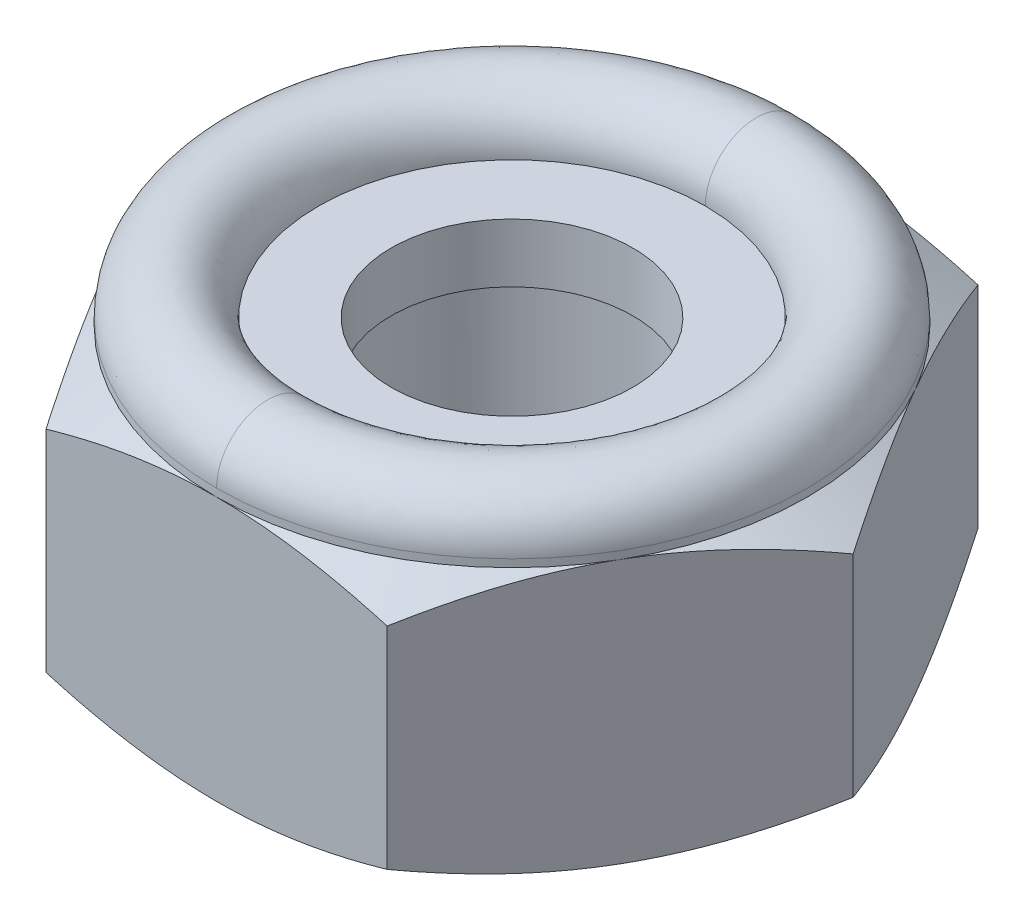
ISO-10303-21;
HEADER;
FILE_DESCRIPTION(('STEP AP214'),'2;1');
FILE_NAME('part.step','',(''),(''),'','','');
FILE_SCHEMA(('AUTOMOTIVE_DESIGN { 1 0 10303 214 1 1 1 1 }'));
ENDSEC;
DATA;
#1=APPLICATION_CONTEXT('core data for automotive mechanical design processes');
#2=APPLICATION_PROTOCOL_DEFINITION('international standard','automotive_design',2000,#1);
#3=PRODUCT_CONTEXT('',#1,'mechanical');
#4=PRODUCT('Part','Part','',(#3));
#5=PRODUCT_RELATED_PRODUCT_CATEGORY('part','',(#4));
#6=PRODUCT_DEFINITION_FORMATION('','',#4);
#7=PRODUCT_DEFINITION_CONTEXT('part definition',#1,'design');
#8=PRODUCT_DEFINITION('design','',#6,#7);
#9=PRODUCT_DEFINITION_SHAPE('','',#8);
#10=(LENGTH_UNIT() NAMED_UNIT(*) SI_UNIT(.MILLI.,.METRE.));
#11=(NAMED_UNIT(*) PLANE_ANGLE_UNIT() SI_UNIT($,.RADIAN.));
#12=(NAMED_UNIT(*) SI_UNIT($,.STERADIAN.) SOLID_ANGLE_UNIT());
#13=UNCERTAINTY_MEASURE_WITH_UNIT(LENGTH_MEASURE(1.E-05),#10,'distance_accuracy_value','');
#14=(GEOMETRIC_REPRESENTATION_CONTEXT(3) GLOBAL_UNCERTAINTY_ASSIGNED_CONTEXT((#13)) GLOBAL_UNIT_ASSIGNED_CONTEXT((#10,
#11,#12)) REPRESENTATION_CONTEXT('',''));
#15=CARTESIAN_POINT('',(0.,0.,0.));
#16=DIRECTION('',(0.,0.,1.));
#17=DIRECTION('',(1.,0.,0.));
#18=AXIS2_PLACEMENT_3D('',#15,#16,#17);
#19=CARTESIAN_POINT('',(-0.17277424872,5.020154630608,-5.496816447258));
#20=CARTESIAN_POINT('',(11.53418376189,5.020154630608,-5.864785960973));
#21=CARTESIAN_POINT('',(11.55212720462,5.020154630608,5.854113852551));
#22=CARTESIAN_POINT('',(-0.1675103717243,5.020154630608,5.496979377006));
#23=CARTESIAN_POINT('',(-0.1747711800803,7.042437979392,-5.560348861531));
#24=CARTESIAN_POINT('',(11.66749629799,7.042437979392,-5.932571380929));
#25=CARTESIAN_POINT('',(11.68564713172,7.042437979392,5.921775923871));
#26=CARTESIAN_POINT('',(-0.1694464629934,7.042437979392,5.560513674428));
#27=CARTESIAN_POINT('',(-0.111173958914,7.045537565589,-3.537001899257));
#28=CARTESIAN_POINT('',(7.421828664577,7.045537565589,-3.773776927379));
#29=CARTESIAN_POINT('',(7.433374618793,7.045537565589,3.76690981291));
#30=CARTESIAN_POINT('',(-0.1077868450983,7.045537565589,3.537106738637));
#31=CARTESIAN_POINT('',(-0.1131120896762,5.021063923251,-3.598663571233));
#32=CARTESIAN_POINT('',(7.551215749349,5.021063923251,-3.839566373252));
#33=CARTESIAN_POINT('',(7.562962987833,5.021063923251,3.832579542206));
#34=CARTESIAN_POINT('',(-0.1096659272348,5.021063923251,3.598770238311));
#35=(BOUNDED_SURFACE() B_SPLINE_SURFACE(3,3,((#19,#20,#21,#22),(#23,#24,#25,#26),(#27,#28,#29,
#30),(#31,#32,#33,#34)),.UNSPECIFIED.,.F.,.F.,.F.) B_SPLINE_SURFACE_WITH_KNOTS((4,4),(4,4),
(-0.01596277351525,1.015468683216),(-0.01596277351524,1.015468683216),
.UNSPECIFIED.) GEOMETRIC_REPRESENTATION_ITEM() RATIONAL_B_SPLINE_SURFACE(((1.065922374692,
0.3333335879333,0.3329828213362,1.064870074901),(0.3333335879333,0.1042395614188,
0.1041298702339,0.3330045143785),(0.3329828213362,0.1041298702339,0.1040202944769,
0.3326540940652),(1.064870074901,0.3330045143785,0.3326540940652,1.063818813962))) REPRESENTATION_ITEM('') SURFACE());
#36=CARTESIAN_POINT('',(0.,5.05,-3.60000000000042));
#37=CARTESIAN_POINT('',(0.101253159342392,5.05,-3.60000969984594));
#38=CARTESIAN_POINT('',(0.202501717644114,5.05,-3.59572828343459));
#39=CARTESIAN_POINT('',(0.404274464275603,5.05,-3.5786582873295));
#40=CARTESIAN_POINT('',(0.504798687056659,5.05,-3.56587011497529));
#41=CARTESIAN_POINT('',(0.704347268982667,5.05,-3.53187361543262));
#42=CARTESIAN_POINT('',(0.80337263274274,5.05,-3.51067121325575));
#43=CARTESIAN_POINT('',(0.999261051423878,5.05,-3.46001826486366));
#44=CARTESIAN_POINT('',(1.09612413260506,5.05,-3.43056781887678));
#45=CARTESIAN_POINT('',(1.38253219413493,5.05,-3.3300833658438));
#46=CARTESIAN_POINT('',(1.56798049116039,5.05,-3.24690177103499));
#47=CARTESIAN_POINT('',(1.92213967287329,5.05,-3.05064229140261));
#48=CARTESIAN_POINT('',(2.09085383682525,5.05,-2.93757027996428));
#49=CARTESIAN_POINT('',(2.40693789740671,5.05,-2.68469523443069));
#50=CARTESIAN_POINT('',(2.55430732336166,5.05,-2.54489161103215));
#51=CARTESIAN_POINT('',(2.82349866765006,5.05,-2.24250880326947));
#52=CARTESIAN_POINT('',(2.94531669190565,5.05,-2.07992615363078));
#53=CARTESIAN_POINT('',(3.15992330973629,5.05,-1.73662261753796));
#54=CARTESIAN_POINT('',(3.25271318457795,5.05,-1.55590253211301));
#55=CARTESIAN_POINT('',(3.40662909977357,5.05,-1.18146122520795));
#56=CARTESIAN_POINT('',(3.46775716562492,5.05,-0.987740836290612));
#57=CARTESIAN_POINT('',(3.55662494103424,5.05,-0.592783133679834));
#58=CARTESIAN_POINT('',(3.58436396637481,5.05,-0.391545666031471));
#59=CARTESIAN_POINT('',(3.60566400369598,5.05,0.012734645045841));
#60=CARTESIAN_POINT('',(3.59922422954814,5.05,0.215777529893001));
#61=CARTESIAN_POINT('',(3.55234796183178,5.05,0.617898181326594));
#62=CARTESIAN_POINT('',(3.51191180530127,5.05,0.816975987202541));
#63=CARTESIAN_POINT('',(3.39819118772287,5.05,1.20551668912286));
#64=CARTESIAN_POINT('',(3.32490683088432,5.05,1.39497961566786));
#65=CARTESIAN_POINT('',(3.14756807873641,5.05,1.75891774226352));
#66=CARTESIAN_POINT('',(3.04351287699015,5.05,1.93339254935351));
#67=CARTESIAN_POINT('',(2.80759197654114,5.05,2.26238771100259));
#68=CARTESIAN_POINT('',(2.67572764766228,5.05,2.41690904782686));
#69=CARTESIAN_POINT('',(2.38795147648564,5.05,2.70160184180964));
#70=CARTESIAN_POINT('',(2.23204286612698,5.05,2.83177656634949));
#71=CARTESIAN_POINT('',(1.90052354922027,5.05,3.06414531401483));
#72=CARTESIAN_POINT('',(1.7249065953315,5.05,3.1663304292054));
#73=CARTESIAN_POINT('',(1.35893536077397,5.05,3.33981426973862));
#74=CARTESIAN_POINT('',(1.16857218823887,5.05,3.41109418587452));
#75=CARTESIAN_POINT('',(0.778729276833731,5.05,3.52057352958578));
#76=CARTESIAN_POINT('',(0.579263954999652,5.05,3.5588234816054));
#77=CARTESIAN_POINT('',(0.315394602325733,5.05,3.58671832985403));
#78=CARTESIAN_POINT('',(0.252363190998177,5.05,3.59170158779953));
#79=CARTESIAN_POINT('',(0.126229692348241,5.05,3.59833787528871));
#80=CARTESIAN_POINT('',(0.0631278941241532,5.05,3.59999639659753));
#81=CARTESIAN_POINT('',(0.,5.05,3.60000000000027));
#82=B_SPLINE_CURVE_WITH_KNOTS('',3,(#36,#37,#38,#39,#40,#41,#42,#43,#44,#45,#46,#47,#48,#49,#50,
#51,#52,#53,#54,#55,#56,#57,#58,#59,#60,#61,#62,#63,#64,#65,#66,#67,#68,#69,#70,#71,#72,#73,#74,
#75,#76,#77,#78,#79,#80,#81),.UNSPECIFIED.,.F.,.F.,(4,2,2,2,2,2,2,2,2,2,2,2,2,2,2,2,2,2,2,2,2,2,
4),(0.,0.303660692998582,0.607306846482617,0.910739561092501,1.21416858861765,1.82077269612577,
2.42725769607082,3.03375606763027,3.64034680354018,4.24691076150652,4.85343591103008,
5.45997348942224,6.06652501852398,6.67307053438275,7.27961412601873,7.88617361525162,
8.49270323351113,9.09915139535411,9.70579234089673,10.3128019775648,10.9188814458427,
11.1085046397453,11.2978143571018),.UNSPECIFIED.);
#83=CARTESIAN_POINT('',(0.,5.05,-3.60000000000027));
#84=VERTEX_POINT('',#83);
#85=CARTESIAN_POINT('',(0.,5.05,3.60000000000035));
#86=VERTEX_POINT('',#85);
#87=EDGE_CURVE('E20',#84,#86,#82,.T.);
#88=CARTESIAN_POINT('',(0.,5.020154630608,5.49953107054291));
#89=CARTESIAN_POINT('',(1.09096364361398E-13,7.042437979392,5.56309486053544));
#90=CARTESIAN_POINT('',(0.,7.045537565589,3.53874866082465));
#91=CARTESIAN_POINT('',(0.,5.021063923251,3.60044078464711));
#92=(BOUNDED_CURVE() B_SPLINE_CURVE(3,(#88,#89,#90,#91),.UNSPECIFIED.,.F.,
.F.) B_SPLINE_CURVE_WITH_KNOTS((4,4),(-0.01596277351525,1.015468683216),
.UNSPECIFIED.) CURVE() GEOMETRIC_REPRESENTATION_ITEM() RATIONAL_B_SPLINE_CURVE((1.0324351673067,
0.322861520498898,0.322521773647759,1.03141592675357)) REPRESENTATION_ITEM(''));
#93=CARTESIAN_POINT('',(0.,5.05,5.50000000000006));
#94=VERTEX_POINT('',#93);
#95=EDGE_CURVE('E122',#94,#86,#92,.T.);
#96=CARTESIAN_POINT('',(0.,5.05,0.));
#97=DIRECTION('',(0.,-1.,0.));
#98=DIRECTION('',(0.,0.,-1.));
#99=AXIS2_PLACEMENT_3D('',#96,#97,#98);
#100=CIRCLE('',#99,5.5);
#101=CARTESIAN_POINT('',(0.,5.05,-5.50000000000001));
#102=VERTEX_POINT('',#101);
#103=EDGE_CURVE('E383',#102,#94,#100,.T.);
#104=CARTESIAN_POINT('',(-1.55309243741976E-13,5.020154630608,-5.4995310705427));
#105=CARTESIAN_POINT('',(-1.5740057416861E-13,7.042437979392,-5.56309486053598));
#106=CARTESIAN_POINT('',(0.,7.045537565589,-3.53874866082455));
#107=CARTESIAN_POINT('',(0.,5.021063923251,-3.60044078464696));
#108=(BOUNDED_CURVE() B_SPLINE_CURVE(3,(#104,#105,#106,#107),.UNSPECIFIED.,.F.,
.F.) B_SPLINE_CURVE_WITH_KNOTS((4,4),(-0.01596277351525,1.015468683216),
.UNSPECIFIED.) CURVE() GEOMETRIC_REPRESENTATION_ITEM() RATIONAL_B_SPLINE_CURVE((1.03243516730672,
0.322861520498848,0.322521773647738,1.03141592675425)) REPRESENTATION_ITEM(''));
#109=EDGE_CURVE('E115',#84,#102,#108,.F.);
#110=ORIENTED_EDGE('',*,*,#87,.T.);
#111=ORIENTED_EDGE('',*,*,#95,.F.);
#112=ORIENTED_EDGE('',*,*,#103,.F.);
#113=ORIENTED_EDGE('',*,*,#109,.F.);
#114=EDGE_LOOP('',(#110,#111,#112,#113));
#115=FACE_BOUND('',#114,.T.);
#116=ADVANCED_FACE('F16',(#115),#35,.T.);
#117=CARTESIAN_POINT('',(0.17277424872,5.020154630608,5.496816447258));
#118=CARTESIAN_POINT('',(-11.53418376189,5.020154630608,5.864785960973));
#119=CARTESIAN_POINT('',(-11.55212720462,5.020154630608,-5.854113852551));
#120=CARTESIAN_POINT('',(0.1675103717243,5.020154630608,-5.496979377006));
#121=CARTESIAN_POINT('',(0.1747711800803,7.042437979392,5.560348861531));
#122=CARTESIAN_POINT('',(-11.66749629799,7.042437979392,5.932571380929));
#123=CARTESIAN_POINT('',(-11.68564713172,7.042437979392,-5.921775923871));
#124=CARTESIAN_POINT('',(0.1694464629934,7.042437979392,-5.560513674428));
#125=CARTESIAN_POINT('',(0.111173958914,7.045537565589,3.537001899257));
#126=CARTESIAN_POINT('',(-7.421828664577,7.045537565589,3.773776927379));
#127=CARTESIAN_POINT('',(-7.433374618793,7.045537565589,-3.76690981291));
#128=CARTESIAN_POINT('',(0.1077868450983,7.045537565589,-3.537106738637));
#129=CARTESIAN_POINT('',(0.1131120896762,5.021063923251,3.598663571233));
#130=CARTESIAN_POINT('',(-7.551215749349,5.021063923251,3.839566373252));
#131=CARTESIAN_POINT('',(-7.562962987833,5.021063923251,-3.832579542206));
#132=CARTESIAN_POINT('',(0.1096659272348,5.021063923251,-3.598770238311));
#133=(BOUNDED_SURFACE() B_SPLINE_SURFACE(3,3,((#117,#118,#119,#120),(#121,#122,#123,#124),(#125,
#126,#127,#128),(#129,#130,#131,#132)),.UNSPECIFIED.,.F.,.F.,
.F.) B_SPLINE_SURFACE_WITH_KNOTS((4,4),(4,4),(-0.01596277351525,1.015468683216),
(-0.01596277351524,1.015468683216),
.UNSPECIFIED.) GEOMETRIC_REPRESENTATION_ITEM() RATIONAL_B_SPLINE_SURFACE(((1.065922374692,
0.3333335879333,0.3329828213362,1.064870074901),(0.3333335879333,0.1042395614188,
0.1041298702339,0.3330045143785),(0.3329828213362,0.1041298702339,0.1040202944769,
0.3326540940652),(1.064870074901,0.3330045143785,0.3326540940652,1.063818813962))) REPRESENTATION_ITEM('') SURFACE());
#134=CARTESIAN_POINT('',(0.,5.05,0.));
#135=DIRECTION('',(0.,-1.,0.));
#136=DIRECTION('',(0.,0.,-1.));
#137=AXIS2_PLACEMENT_3D('',#134,#135,#136);
#138=CIRCLE('',#137,5.5);
#139=EDGE_CURVE('E386',#94,#102,#138,.T.);
#140=CARTESIAN_POINT('',(0.,5.05,3.60000000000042));
#141=CARTESIAN_POINT('',(-0.101253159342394,5.05,3.60000969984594));
#142=CARTESIAN_POINT('',(-0.202501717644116,5.05,3.59572828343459));
#143=CARTESIAN_POINT('',(-0.404274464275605,5.05,3.5786582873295));
#144=CARTESIAN_POINT('',(-0.50479868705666,5.05,3.56587011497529));
#145=CARTESIAN_POINT('',(-0.704347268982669,5.05,3.53187361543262));
#146=CARTESIAN_POINT('',(-0.803372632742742,5.05,3.51067121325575));
#147=CARTESIAN_POINT('',(-0.999261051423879,5.05,3.46001826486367));
#148=CARTESIAN_POINT('',(-1.09612413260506,5.05,3.43056781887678));
#149=CARTESIAN_POINT('',(-1.38253219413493,5.05,3.3300833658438));
#150=CARTESIAN_POINT('',(-1.56798049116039,5.05,3.24690177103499));
#151=CARTESIAN_POINT('',(-1.92213967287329,5.05,3.05064229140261));
#152=CARTESIAN_POINT('',(-2.09085383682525,5.05,2.93757027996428));
#153=CARTESIAN_POINT('',(-2.40693789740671,5.05,2.68469523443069));
#154=CARTESIAN_POINT('',(-2.55430732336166,5.05,2.54489161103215));
#155=CARTESIAN_POINT('',(-2.82349866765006,5.05,2.24250880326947));
#156=CARTESIAN_POINT('',(-2.94531669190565,5.05,2.07992615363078));
#157=CARTESIAN_POINT('',(-3.15992330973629,5.05,1.73662261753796));
#158=CARTESIAN_POINT('',(-3.25271318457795,5.05,1.55590253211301));
#159=CARTESIAN_POINT('',(-3.40662909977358,5.05,1.18146122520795));
#160=CARTESIAN_POINT('',(-3.46775716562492,5.05,0.987740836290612));
#161=CARTESIAN_POINT('',(-3.55662494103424,5.05,0.592783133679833));
#162=CARTESIAN_POINT('',(-3.58436396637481,5.05,0.39154566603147));
#163=CARTESIAN_POINT('',(-3.60566400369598,5.05,-0.0127346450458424));
#164=CARTESIAN_POINT('',(-3.59922422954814,5.05,-0.215777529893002));
#165=CARTESIAN_POINT('',(-3.55234796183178,5.05,-0.617898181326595));
#166=CARTESIAN_POINT('',(-3.51191180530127,5.05,-0.816975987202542));
#167=CARTESIAN_POINT('',(-3.39819118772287,5.05,-1.20551668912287));
#168=CARTESIAN_POINT('',(-3.32490683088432,5.05,-1.39497961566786));
#169=CARTESIAN_POINT('',(-3.1475680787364,5.05,-1.75891774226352));
#170=CARTESIAN_POINT('',(-3.04351287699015,5.05,-1.93339254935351));
#171=CARTESIAN_POINT('',(-2.80759197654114,5.05,-2.2623877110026));
#172=CARTESIAN_POINT('',(-2.67572764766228,5.05,-2.41690904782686));
#173=CARTESIAN_POINT('',(-2.38795147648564,5.05,-2.70160184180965));
#174=CARTESIAN_POINT('',(-2.23204286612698,5.05,-2.83177656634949));
#175=CARTESIAN_POINT('',(-1.90052354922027,5.05,-3.06414531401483));
#176=CARTESIAN_POINT('',(-1.7249065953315,5.05,-3.1663304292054));
#177=CARTESIAN_POINT('',(-1.35893536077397,5.05,-3.33981426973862));
#178=CARTESIAN_POINT('',(-1.16857218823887,5.05,-3.41109418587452));
#179=CARTESIAN_POINT('',(-0.778729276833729,5.05,-3.52057352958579));
#180=CARTESIAN_POINT('',(-0.579263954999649,5.05,-3.5588234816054));
#181=CARTESIAN_POINT('',(-0.315394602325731,5.05,-3.58671832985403));
#182=CARTESIAN_POINT('',(-0.252363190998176,5.05,-3.59170158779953));
#183=CARTESIAN_POINT('',(-0.126229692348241,5.05,-3.59833787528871));
#184=CARTESIAN_POINT('',(-0.0631278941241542,5.05,-3.59999639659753));
#185=CARTESIAN_POINT('',(0.,5.05,-3.60000000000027));
#186=B_SPLINE_CURVE_WITH_KNOTS('',3,(#140,#141,#142,#143,#144,#145,#146,#147,#148,#149,#150,
#151,#152,#153,#154,#155,#156,#157,#158,#159,#160,#161,#162,#163,#164,#165,#166,#167,#168,#169,
#170,#171,#172,#173,#174,#175,#176,#177,#178,#179,#180,#181,#182,#183,#184,#185),.UNSPECIFIED.,
.F.,.F.,(4,2,2,2,2,2,2,2,2,2,2,2,2,2,2,2,2,2,2,2,2,2,4),(0.,0.303660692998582,0.607306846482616,
0.9107395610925,1.21416858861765,1.82077269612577,2.42725769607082,3.03375606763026,
3.64034680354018,4.24691076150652,4.85343591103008,5.45997348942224,6.06652501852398,
6.67307053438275,7.27961412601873,7.88617361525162,8.49270323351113,9.09915139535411,
9.70579234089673,10.3128019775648,10.9188814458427,11.1085046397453,11.2978143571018),.UNSPECIFIED.);
#187=EDGE_CURVE('E387',#86,#84,#186,.T.);
#188=ORIENTED_EDGE('',*,*,#109,.T.);
#189=ORIENTED_EDGE('',*,*,#139,.F.);
#190=ORIENTED_EDGE('',*,*,#95,.T.);
#191=ORIENTED_EDGE('',*,*,#187,.T.);
#192=EDGE_LOOP('',(#188,#189,#190,#191));
#193=FACE_BOUND('',#192,.T.);
#194=ADVANCED_FACE('F503',(#193),#133,.T.);
#195=CARTESIAN_POINT('',(4.55,5.05,0.));
#196=DIRECTION('',(0.,-1.,0.));
#197=DIRECTION('',(0.,0.,-1.));
#198=AXIS2_PLACEMENT_3D('',#195,#196,#197);
#199=PLANE('',#198);
#200=CARTESIAN_POINT('',(0.,5.05,0.));
#201=DIRECTION('',(0.,1.,0.));
#202=DIRECTION('',(0.,0.,1.));
#203=AXIS2_PLACEMENT_3D('',#200,#201,#202);
#204=CIRCLE('',#203,2.25);
#205=CARTESIAN_POINT('',(0.,5.05,2.25));
#206=VERTEX_POINT('',#205);
#207=EDGE_CURVE('E379',#206,#206,#204,.F.);
#208=ORIENTED_EDGE('',*,*,#207,.T.);
#209=EDGE_LOOP('',(#208));
#210=FACE_BOUND('',#209,.T.);
#211=ORIENTED_EDGE('',*,*,#87,.F.);
#212=ORIENTED_EDGE('',*,*,#187,.F.);
#213=EDGE_LOOP('',(#211,#212));
#214=FACE_BOUND('',#213,.T.);
#215=ADVANCED_FACE('F507',(#210,#214),#199,.F.);
#216=CARTESIAN_POINT('',(0.,0.,0.));
#217=DIRECTION('',(0.,-1.,0.));
#218=DIRECTION('',(0.,0.,-1.));
#219=AXIS2_PLACEMENT_3D('',#216,#217,#218);
#220=CYLINDRICAL_SURFACE('',#219,5.5);
#221=CARTESIAN_POINT('',(0.,4.90705642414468,0.));
#222=DIRECTION('',(0.,-1.,0.));
#223=DIRECTION('',(0.,0.,-1.));
#224=AXIS2_PLACEMENT_3D('',#221,#222,#223);
#225=CIRCLE('',#224,5.49999999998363);
#226=CARTESIAN_POINT('',(0.,4.90705642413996,-5.49999999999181));
#227=VERTEX_POINT('',#226);
#228=CARTESIAN_POINT('',(4.76313972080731,4.90705642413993,-2.74999999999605));
#229=VERTEX_POINT('',#228);
#230=EDGE_CURVE('E367',#227,#229,#225,.T.);
#231=ORIENTED_EDGE('',*,*,#230,.F.);
#232=CARTESIAN_POINT('',(0.,4.90705642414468,0.));
#233=DIRECTION('',(0.,-1.,0.));
#234=DIRECTION('',(0.,0.,-1.));
#235=AXIS2_PLACEMENT_3D('',#232,#233,#234);
#236=CIRCLE('',#235,5.49999999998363);
#237=CARTESIAN_POINT('',(-4.76313972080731,4.90705642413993,-2.74999999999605));
#238=VERTEX_POINT('',#237);
#239=EDGE_CURVE('E364',#238,#227,#236,.T.);
#240=ORIENTED_EDGE('',*,*,#239,.F.);
#241=CARTESIAN_POINT('',(0.,4.90705642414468,0.));
#242=DIRECTION('',(0.,-1.,0.));
#243=DIRECTION('',(0.,0.,-1.));
#244=AXIS2_PLACEMENT_3D('',#241,#242,#243);
#245=CIRCLE('',#244,5.49999999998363);
#246=CARTESIAN_POINT('',(-4.76313972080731,4.90705642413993,2.74999999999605));
#247=VERTEX_POINT('',#246);
#248=EDGE_CURVE('E360',#247,#238,#245,.T.);
#249=ORIENTED_EDGE('',*,*,#248,.F.);
#250=CARTESIAN_POINT('',(0.,4.90705642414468,0.));
#251=DIRECTION('',(0.,-1.,0.));
#252=DIRECTION('',(0.,0.,-1.));
#253=AXIS2_PLACEMENT_3D('',#250,#251,#252);
#254=CIRCLE('',#253,5.49999999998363);
#255=CARTESIAN_POINT('',(0.,4.90705642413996,5.49999999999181));
#256=VERTEX_POINT('',#255);
#257=EDGE_CURVE('E370',#256,#247,#254,.T.);
#258=ORIENTED_EDGE('',*,*,#257,.F.);
#259=CARTESIAN_POINT('',(0.,4.90705642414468,0.));
#260=DIRECTION('',(0.,-1.,0.));
#261=DIRECTION('',(0.,0.,-1.));
#262=AXIS2_PLACEMENT_3D('',#259,#260,#261);
#263=CIRCLE('',#262,5.49999999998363);
#264=CARTESIAN_POINT('',(4.76313972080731,4.90705642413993,2.74999999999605));
#265=VERTEX_POINT('',#264);
#266=EDGE_CURVE('E373',#265,#256,#263,.T.);
#267=ORIENTED_EDGE('',*,*,#266,.F.);
#268=CARTESIAN_POINT('',(0.,4.90705642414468,0.));
#269=DIRECTION('',(0.,-1.,0.));
#270=DIRECTION('',(0.,0.,-1.));
#271=AXIS2_PLACEMENT_3D('',#268,#269,#270);
#272=CIRCLE('',#271,5.49999999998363);
#273=EDGE_CURVE('E376',#229,#265,#272,.T.);
#274=ORIENTED_EDGE('',*,*,#273,.F.);
#275=EDGE_LOOP('',(#231,#240,#249,#258,#267,#274));
#276=FACE_BOUND('',#275,.T.);
#277=ORIENTED_EDGE('',*,*,#139,.T.);
#278=ORIENTED_EDGE('',*,*,#103,.T.);
#279=EDGE_LOOP('',(#277,#278));
#280=FACE_BOUND('',#279,.T.);
#281=ADVANCED_FACE('F457',(#276,#280),#220,.T.);
#282=CARTESIAN_POINT('',(0.,9.913170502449,0.));
#283=DIRECTION('',(0.,1.,0.));
#284=DIRECTION('',(0.,0.,1.));
#285=AXIS2_PLACEMENT_3D('',#282,#283,#284);
#286=CYLINDRICAL_SURFACE('',#285,2.25);
#287=ORIENTED_EDGE('',*,*,#207,.F.);
#288=EDGE_LOOP('',(#287));
#289=FACE_BOUND('',#288,.T.);
#290=CARTESIAN_POINT('',(0.,3.95591825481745,0.));
#291=DIRECTION('',(0.,1.,0.));
#292=DIRECTION('',(0.,0.,1.));
#293=AXIS2_PLACEMENT_3D('',#290,#291,#292);
#294=CIRCLE('',#293,2.25000000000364);
#295=CARTESIAN_POINT('',(0.,3.95591825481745,2.25000000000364));
#296=VERTEX_POINT('',#295);
#297=EDGE_CURVE('E363',#296,#296,#294,.T.);
#298=ORIENTED_EDGE('',*,*,#297,.F.);
#299=EDGE_LOOP('',(#298));
#300=FACE_BOUND('',#299,.T.);
#301=ADVANCED_FACE('F514',(#289,#300),#286,.F.);
#302=CARTESIAN_POINT('',(0.,4.41286879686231,0.));
#303=DIRECTION('',(0.,-1.,0.));
#304=DIRECTION('',(0.,0.,-1.));
#305=AXIS2_PLACEMENT_3D('',#302,#303,#304);
#306=CONICAL_SURFACE('',#305,6.35595807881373,1.0471975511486);
#307=ORIENTED_EDGE('',*,*,#273,.T.);
#308=CARTESIAN_POINT('',(4.76313972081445,4.90705642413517,2.75000000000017));
#309=CARTESIAN_POINT('',(4.83052924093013,4.90707890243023,2.63327792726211));
#310=CARTESIAN_POINT('',(4.89791551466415,4.90419665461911,2.51656147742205));
#311=CARTESIAN_POINT('',(5.03255574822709,4.89278977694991,2.28335775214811));
#312=CARTESIAN_POINT('',(5.0998097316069,4.88426626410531,2.16687043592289));
#313=CARTESIAN_POINT('',(5.23375097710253,4.86180005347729,1.93487739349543));
#314=CARTESIAN_POINT('',(5.30043939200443,4.84788463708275,1.8193696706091));
#315=CARTESIAN_POINT('',(5.43349849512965,4.8149339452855,1.58890454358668));
#316=CARTESIAN_POINT('',(5.49986917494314,4.79589853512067,1.47394715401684));
#317=CARTESIAN_POINT('',(5.6982294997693,4.73170036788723,1.13037699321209));
#318=CARTESIAN_POINT('',(5.82964290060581,4.67941450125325,0.902762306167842));
#319=CARTESIAN_POINT('',(6.09133960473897,4.55882991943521,0.449490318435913));
#320=CARTESIAN_POINT('',(6.22161377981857,4.49045123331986,0.22384882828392));
#321=CARTESIAN_POINT('',(6.35085296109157,4.41581623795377,-9.50553161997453E-12));
#322=B_SPLINE_CURVE_WITH_KNOTS('',3,(#308,#309,#310,#311,#312,#313,#314,#315,#316,#317,#318,
#319,#320,#321),.UNSPECIFIED.,.F.,.F.,(4,2,2,2,2,2,4),(0.,0.404295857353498,0.808511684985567,
1.21070846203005,1.61291582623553,2.41627637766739,3.22371670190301),.UNSPECIFIED.);
#323=CARTESIAN_POINT('',(6.35085296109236,4.41581623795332,1.36267099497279E-12));
#324=VERTEX_POINT('',#323);
#325=EDGE_CURVE('E286',#265,#324,#322,.T.);
#326=ORIENTED_EDGE('',*,*,#325,.T.);
#327=CARTESIAN_POINT('',(6.35085296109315,4.41581623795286,1.22315300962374E-11));
#328=CARTESIAN_POINT('',(6.22161377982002,4.49045123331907,-0.223848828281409));
#329=CARTESIAN_POINT('',(6.09133960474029,4.55882991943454,-0.44949031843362));
#330=CARTESIAN_POINT('',(5.82964290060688,4.67941450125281,-0.90276230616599));
#331=CARTESIAN_POINT('',(5.69822949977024,4.73170036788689,-1.13037699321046));
#332=CARTESIAN_POINT('',(5.49986917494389,4.79589853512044,-1.47394715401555));
#333=CARTESIAN_POINT('',(5.43349849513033,4.81493394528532,-1.5889045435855));
#334=CARTESIAN_POINT('',(5.30043939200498,4.84788463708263,-1.81936967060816));
#335=CARTESIAN_POINT('',(5.233750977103,4.8618000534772,-1.9348773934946));
#336=CARTESIAN_POINT('',(5.09980973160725,4.88426626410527,-2.1668704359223));
#337=CARTESIAN_POINT('',(5.03255574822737,4.89278977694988,-2.28335775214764));
#338=CARTESIAN_POINT('',(4.89791551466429,4.9041966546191,-2.51656147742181));
#339=CARTESIAN_POINT('',(4.8305292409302,4.90707890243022,-2.63327792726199));
#340=CARTESIAN_POINT('',(4.76313972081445,4.90705642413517,-2.75000000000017));
#341=B_SPLINE_CURVE_WITH_KNOTS('',3,(#327,#328,#329,#330,#331,#332,#333,#334,#335,#336,#337,
#338,#339,#340),.UNSPECIFIED.,.F.,.F.,(4,2,2,2,2,2,4),(0.,0.807440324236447,1.61080087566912,
2.01300823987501,2.4152050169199,2.81942084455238,3.22371670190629),.UNSPECIFIED.);
#342=EDGE_CURVE('E382',#324,#229,#341,.T.);
#343=ORIENTED_EDGE('',*,*,#342,.T.);
#344=EDGE_LOOP('',(#307,#326,#343));
#345=FACE_BOUND('',#344,.T.);
#346=ADVANCED_FACE('F273',(#345),#306,.T.);
#347=CARTESIAN_POINT('',(0.,4.41286879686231,0.));
#348=DIRECTION('',(0.,-1.,0.));
#349=DIRECTION('',(0.,0.,-1.));
#350=AXIS2_PLACEMENT_3D('',#347,#348,#349);
#351=CONICAL_SURFACE('',#350,6.35595807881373,1.0471975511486);
#352=CARTESIAN_POINT('',(3.17542648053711,4.41581623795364,5.50000000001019));
#353=CARTESIAN_POINT('',(3.30466566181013,4.49045123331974,5.27615117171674));
#354=CARTESIAN_POINT('',(3.43493983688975,4.55882991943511,5.05050968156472));
#355=CARTESIAN_POINT('',(3.69663654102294,4.67941450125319,4.59723769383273));
#356=CARTESIAN_POINT('',(3.82804994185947,4.73170036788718,4.36962300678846));
#357=CARTESIAN_POINT('',(4.02641026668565,4.79589853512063,4.02605284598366));
#358=CARTESIAN_POINT('',(4.09278094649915,4.81493394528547,3.91109545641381));
#359=CARTESIAN_POINT('',(4.22584004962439,4.84788463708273,3.68063032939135));
#360=CARTESIAN_POINT('',(4.2925284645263,4.86180005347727,3.56512260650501));
#361=CARTESIAN_POINT('',(4.42646971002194,4.8842662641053,3.33312956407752));
#362=CARTESIAN_POINT('',(4.49372369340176,4.8927897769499,3.21664224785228));
#363=CARTESIAN_POINT('',(4.62836392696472,4.9041966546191,2.98343852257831));
#364=CARTESIAN_POINT('',(4.69575020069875,4.90707890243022,2.86672207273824));
#365=CARTESIAN_POINT('',(4.76313972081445,4.90705642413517,2.75000000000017));
#366=B_SPLINE_CURVE_WITH_KNOTS('',3,(#352,#353,#354,#355,#356,#357,#358,#359,#360,#361,#362,
#363,#364,#365),.UNSPECIFIED.,.F.,.F.,(4,2,2,2,2,2,4),(0.,0.807440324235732,1.6108008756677,
2.01300823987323,2.41520501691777,2.81942084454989,3.22371670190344),.UNSPECIFIED.);
#367=CARTESIAN_POINT('',(3.17542648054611,4.41581623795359,5.5000000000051));
#368=VERTEX_POINT('',#367);
#369=EDGE_CURVE('E280',#368,#265,#366,.T.);
#370=ORIENTED_EDGE('',*,*,#369,.T.);
#371=ORIENTED_EDGE('',*,*,#266,.T.);
#372=CARTESIAN_POINT('',(0.,4.90705642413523,5.5));
#373=CARTESIAN_POINT('',(0.134779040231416,4.90707890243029,5.5));
#374=CARTESIAN_POINT('',(0.269551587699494,4.90419665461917,5.5));
#375=CARTESIAN_POINT('',(0.538832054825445,4.89278977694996,5.5));
#376=CARTESIAN_POINT('',(0.673340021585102,4.88426626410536,5.5));
#377=CARTESIAN_POINT('',(0.941222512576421,4.86180005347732,5.5));
#378=CARTESIAN_POINT('',(1.07459934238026,4.84788463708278,5.5));
#379=CARTESIAN_POINT('',(1.34071754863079,4.81493394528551,5.5));
#380=CARTESIAN_POINT('',(1.4734589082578,4.79589853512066,5.5));
#381=CARTESIAN_POINT('',(1.87017955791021,4.73170036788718,5.5));
#382=CARTESIAN_POINT('',(2.13300635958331,4.67941450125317,5.5));
#383=CARTESIAN_POINT('',(2.65639976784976,4.55882991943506,5.5));
#384=CARTESIAN_POINT('',(2.91694811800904,4.49045123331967,5.5));
#385=CARTESIAN_POINT('',(3.1754264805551,4.41581623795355,5.5));
#386=B_SPLINE_CURVE_WITH_KNOTS('',3,(#372,#373,#374,#375,#376,#377,#378,#379,#380,#381,#382,
#383,#384,#385),.UNSPECIFIED.,.F.,.F.,(4,2,2,2,2,2,4),(0.,0.404295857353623,0.808511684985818,
1.21070846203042,1.61291582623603,2.41627637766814,3.22371670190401),.UNSPECIFIED.);
#387=EDGE_CURVE('E253',#256,#368,#386,.T.);
#388=ORIENTED_EDGE('',*,*,#387,.T.);
#389=EDGE_LOOP('',(#370,#371,#388));
#390=FACE_BOUND('',#389,.T.);
#391=ADVANCED_FACE('F268',(#390),#351,.T.);
#392=CARTESIAN_POINT('',(0.,4.41286879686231,0.));
#393=DIRECTION('',(0.,-1.,0.));
#394=DIRECTION('',(0.,0.,-1.));
#395=AXIS2_PLACEMENT_3D('',#392,#393,#394);
#396=CONICAL_SURFACE('',#395,6.35595807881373,1.0471975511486);
#397=CARTESIAN_POINT('',(-3.17542648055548,4.41581623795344,5.5));
#398=CARTESIAN_POINT('',(-2.91694811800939,4.49045123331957,5.5));
#399=CARTESIAN_POINT('',(-2.65639976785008,4.55882991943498,5.5));
#400=CARTESIAN_POINT('',(-2.13300635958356,4.67941450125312,5.5));
#401=CARTESIAN_POINT('',(-1.87017955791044,4.73170036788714,5.5));
#402=CARTESIAN_POINT('',(-1.47345890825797,4.79589853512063,5.5));
#403=CARTESIAN_POINT('',(-1.34071754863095,4.81493394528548,5.5));
#404=CARTESIAN_POINT('',(-1.07459934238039,4.84788463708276,5.5));
#405=CARTESIAN_POINT('',(-0.941222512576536,4.86180005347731,5.5));
#406=CARTESIAN_POINT('',(-0.673340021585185,4.88426626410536,5.5));
#407=CARTESIAN_POINT('',(-0.538832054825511,4.89278977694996,5.5));
#408=CARTESIAN_POINT('',(-0.269551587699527,4.90419665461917,5.5));
#409=CARTESIAN_POINT('',(-0.134779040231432,4.90707890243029,5.5));
#410=CARTESIAN_POINT('',(0.,4.90705642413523,5.5));
#411=B_SPLINE_CURVE_WITH_KNOTS('',3,(#397,#398,#399,#400,#401,#402,#403,#404,#405,#406,#407,
#408,#409,#410),.UNSPECIFIED.,.F.,.F.,(4,2,2,2,2,2,4),(0.,0.807440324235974,1.61080087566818,
2.01300823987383,2.41520501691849,2.81942084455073,3.2237167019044),.UNSPECIFIED.);
#412=CARTESIAN_POINT('',(-3.17542648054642,4.41581623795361,5.50000000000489));
#413=VERTEX_POINT('',#412);
#414=EDGE_CURVE('E260',#413,#256,#411,.T.);
#415=ORIENTED_EDGE('',*,*,#414,.T.);
#416=ORIENTED_EDGE('',*,*,#257,.T.);
#417=CARTESIAN_POINT('',(-4.76313972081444,4.90705642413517,2.75000000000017));
#418=CARTESIAN_POINT('',(-4.69575020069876,4.90707890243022,2.86672207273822));
#419=CARTESIAN_POINT('',(-4.62836392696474,4.9041966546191,2.98343852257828));
#420=CARTESIAN_POINT('',(-4.4937236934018,4.89278977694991,3.21664224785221));
#421=CARTESIAN_POINT('',(-4.42646971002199,4.88426626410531,3.33312956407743));
#422=CARTESIAN_POINT('',(-4.29252846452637,4.86180005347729,3.56512260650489));
#423=CARTESIAN_POINT('',(-4.22584004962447,4.84788463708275,3.68063032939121));
#424=CARTESIAN_POINT('',(-4.09278094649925,4.8149339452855,3.91109545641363));
#425=CARTESIAN_POINT('',(-4.02641026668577,4.79589853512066,4.02605284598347));
#426=CARTESIAN_POINT('',(-3.82804994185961,4.73170036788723,4.36962300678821));
#427=CARTESIAN_POINT('',(-3.6966365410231,4.67941450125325,4.59723769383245));
#428=CARTESIAN_POINT('',(-3.43493983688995,4.55882991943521,5.05050968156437));
#429=CARTESIAN_POINT('',(-3.30466566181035,4.49045123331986,5.27615117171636));
#430=CARTESIAN_POINT('',(-3.17542648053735,4.41581623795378,5.50000000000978));
#431=B_SPLINE_CURVE_WITH_KNOTS('',3,(#417,#418,#419,#420,#421,#422,#423,#424,#425,#426,#427,
#428,#429,#430),.UNSPECIFIED.,.F.,.F.,(4,2,2,2,2,2,4),(0.,0.404295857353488,0.808511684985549,
1.21070846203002,1.61291582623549,2.41627637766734,3.22371670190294),.UNSPECIFIED.);
#432=EDGE_CURVE('E246',#247,#413,#431,.T.);
#433=ORIENTED_EDGE('',*,*,#432,.T.);
#434=EDGE_LOOP('',(#415,#416,#433));
#435=FACE_BOUND('',#434,.T.);
#436=ADVANCED_FACE('F272',(#435),#396,.T.);
#437=CARTESIAN_POINT('',(0.,4.41286879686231,0.));
#438=DIRECTION('',(0.,-1.,0.));
#439=DIRECTION('',(0.,0.,-1.));
#440=AXIS2_PLACEMENT_3D('',#437,#438,#439);
#441=CONICAL_SURFACE('',#440,6.35595807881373,1.0471975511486);
#442=ORIENTED_EDGE('',*,*,#230,.T.);
#443=CARTESIAN_POINT('',(4.76313972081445,4.90705642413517,-2.75000000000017));
#444=CARTESIAN_POINT('',(4.69575020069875,4.90707890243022,-2.86672207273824));
#445=CARTESIAN_POINT('',(4.62836392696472,4.9041966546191,-2.98343852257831));
#446=CARTESIAN_POINT('',(4.49372369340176,4.8927897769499,-3.21664224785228));
#447=CARTESIAN_POINT('',(4.42646971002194,4.8842662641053,-3.33312956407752));
#448=CARTESIAN_POINT('',(4.2925284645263,4.86180005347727,-3.56512260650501));
#449=CARTESIAN_POINT('',(4.22584004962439,4.84788463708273,-3.68063032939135));
#450=CARTESIAN_POINT('',(4.09278094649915,4.81493394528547,-3.91109545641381));
#451=CARTESIAN_POINT('',(4.02641026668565,4.79589853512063,-4.02605284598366));
#452=CARTESIAN_POINT('',(3.82804994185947,4.73170036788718,-4.36962300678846));
#453=CARTESIAN_POINT('',(3.69663654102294,4.67941450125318,-4.59723769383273));
#454=CARTESIAN_POINT('',(3.43493983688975,4.55882991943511,-5.05050968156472));
#455=CARTESIAN_POINT('',(3.30466566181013,4.49045123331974,-5.27615117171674));
#456=CARTESIAN_POINT('',(3.17542648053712,4.41581623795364,-5.50000000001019));
#457=B_SPLINE_CURVE_WITH_KNOTS('',3,(#443,#444,#445,#446,#447,#448,#449,#450,#451,#452,#453,
#454,#455,#456),.UNSPECIFIED.,.F.,.F.,(4,2,2,2,2,2,4),(0.,0.404295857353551,0.808511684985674,
1.21070846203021,1.61291582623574,2.41627637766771,3.22371670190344),.UNSPECIFIED.);
#458=CARTESIAN_POINT('',(3.17542647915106,4.41581623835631,-5.5000000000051));
#459=VERTEX_POINT('',#458);
#460=EDGE_CURVE('E291',#229,#459,#457,.T.);
#461=ORIENTED_EDGE('',*,*,#460,.T.);
#462=CARTESIAN_POINT('',(3.1754264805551,4.41581623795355,-5.5));
#463=CARTESIAN_POINT('',(2.91694811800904,4.49045123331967,-5.5));
#464=CARTESIAN_POINT('',(2.65639976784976,4.55882991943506,-5.5));
#465=CARTESIAN_POINT('',(2.13300635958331,4.67941450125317,-5.5));
#466=CARTESIAN_POINT('',(1.87017955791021,4.73170036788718,-5.5));
#467=CARTESIAN_POINT('',(1.4734589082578,4.79589853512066,-5.5));
#468=CARTESIAN_POINT('',(1.34071754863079,4.81493394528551,-5.5));
#469=CARTESIAN_POINT('',(1.07459934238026,4.84788463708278,-5.5));
#470=CARTESIAN_POINT('',(0.941222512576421,4.86180005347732,-5.5));
#471=CARTESIAN_POINT('',(0.673340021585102,4.88426626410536,-5.5));
#472=CARTESIAN_POINT('',(0.538832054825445,4.89278977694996,-5.5));
#473=CARTESIAN_POINT('',(0.269551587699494,4.90419665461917,-5.5));
#474=CARTESIAN_POINT('',(0.134779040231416,4.90707890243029,-5.5));
#475=CARTESIAN_POINT('',(0.,4.90705642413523,-5.5));
#476=B_SPLINE_CURVE_WITH_KNOTS('',3,(#462,#463,#464,#465,#466,#467,#468,#469,#470,#471,#472,
#473,#474,#475),.UNSPECIFIED.,.F.,.F.,(4,2,2,2,2,2,4),(0.,0.807440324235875,1.61080087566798,
2.01300823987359,2.41520501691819,2.81942084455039,3.22371670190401),.UNSPECIFIED.);
#477=EDGE_CURVE('E452',#459,#227,#476,.T.);
#478=ORIENTED_EDGE('',*,*,#477,.T.);
#479=EDGE_LOOP('',(#442,#461,#478));
#480=FACE_BOUND('',#479,.T.);
#481=ADVANCED_FACE('F465',(#480),#441,.T.);
#482=CARTESIAN_POINT('',(0.,4.41286879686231,0.));
#483=DIRECTION('',(0.,-1.,0.));
#484=DIRECTION('',(0.,0.,-1.));
#485=AXIS2_PLACEMENT_3D('',#482,#483,#484);
#486=CONICAL_SURFACE('',#485,6.35595807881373,1.0471975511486);
#487=ORIENTED_EDGE('',*,*,#239,.T.);
#488=CARTESIAN_POINT('',(0.,4.90705642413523,-5.5));
#489=CARTESIAN_POINT('',(-0.134779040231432,4.90707890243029,-5.5));
#490=CARTESIAN_POINT('',(-0.269551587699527,4.90419665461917,-5.5));
#491=CARTESIAN_POINT('',(-0.538832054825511,4.89278977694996,-5.5));
#492=CARTESIAN_POINT('',(-0.673340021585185,4.88426626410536,-5.5));
#493=CARTESIAN_POINT('',(-0.941222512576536,4.86180005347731,-5.5));
#494=CARTESIAN_POINT('',(-1.07459934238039,4.84788463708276,-5.5));
#495=CARTESIAN_POINT('',(-1.34071754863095,4.81493394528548,-5.5));
#496=CARTESIAN_POINT('',(-1.47345890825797,4.79589853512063,-5.5));
#497=CARTESIAN_POINT('',(-1.87017955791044,4.73170036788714,-5.5));
#498=CARTESIAN_POINT('',(-2.13300635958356,4.67941450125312,-5.5));
#499=CARTESIAN_POINT('',(-2.65639976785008,4.55882991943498,-5.5));
#500=CARTESIAN_POINT('',(-2.91694811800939,4.49045123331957,-5.5));
#501=CARTESIAN_POINT('',(-3.17542648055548,4.41581623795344,-5.5));
#502=B_SPLINE_CURVE_WITH_KNOTS('',3,(#488,#489,#490,#491,#492,#493,#494,#495,#496,#497,#498,
#499,#500,#501),.UNSPECIFIED.,.F.,.F.,(4,2,2,2,2,2,4),(0.,0.404295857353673,0.808511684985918,
1.21070846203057,1.61291582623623,2.41627637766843,3.22371670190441),.UNSPECIFIED.);
#503=CARTESIAN_POINT('',(-3.17542648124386,4.41581623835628,-5.49999999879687));
#504=VERTEX_POINT('',#503);
#505=EDGE_CURVE('E145',#227,#504,#502,.T.);
#506=ORIENTED_EDGE('',*,*,#505,.T.);
#507=CARTESIAN_POINT('',(-3.17542648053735,4.41581623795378,-5.50000000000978));
#508=CARTESIAN_POINT('',(-3.30466566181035,4.49045123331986,-5.27615117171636));
#509=CARTESIAN_POINT('',(-3.43493983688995,4.55882991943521,-5.05050968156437));
#510=CARTESIAN_POINT('',(-3.69663654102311,4.67941450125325,-4.59723769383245));
#511=CARTESIAN_POINT('',(-3.82804994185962,4.73170036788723,-4.36962300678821));
#512=CARTESIAN_POINT('',(-4.02641026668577,4.79589853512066,-4.02605284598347));
#513=CARTESIAN_POINT('',(-4.09278094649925,4.8149339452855,-3.91109545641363));
#514=CARTESIAN_POINT('',(-4.22584004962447,4.84788463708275,-3.68063032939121));
#515=CARTESIAN_POINT('',(-4.29252846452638,4.86180005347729,-3.56512260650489));
#516=CARTESIAN_POINT('',(-4.42646971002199,4.88426626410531,-3.33312956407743));
#517=CARTESIAN_POINT('',(-4.4937236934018,4.89278977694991,-3.21664224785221));
#518=CARTESIAN_POINT('',(-4.62836392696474,4.9041966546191,-2.98343852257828));
#519=CARTESIAN_POINT('',(-4.69575020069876,4.90707890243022,-2.86672207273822));
#520=CARTESIAN_POINT('',(-4.76313972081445,4.90705642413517,-2.75000000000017));
#521=B_SPLINE_CURVE_WITH_KNOTS('',3,(#507,#508,#509,#510,#511,#512,#513,#514,#515,#516,#517,
#518,#519,#520),.UNSPECIFIED.,.F.,.F.,(4,2,2,2,2,2,4),(0.,0.807440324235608,1.61080087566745,
2.01300823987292,2.41520501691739,2.81942084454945,3.22371670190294),.UNSPECIFIED.);
#522=EDGE_CURVE('E218',#504,#238,#521,.T.);
#523=ORIENTED_EDGE('',*,*,#522,.T.);
#524=EDGE_LOOP('',(#487,#506,#523));
#525=FACE_BOUND('',#524,.T.);
#526=ADVANCED_FACE('F235',(#525),#486,.T.);
#527=CARTESIAN_POINT('',(0.,4.41286879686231,0.));
#528=DIRECTION('',(0.,-1.,0.));
#529=DIRECTION('',(0.,0.,-1.));
#530=AXIS2_PLACEMENT_3D('',#527,#528,#529);
#531=CONICAL_SURFACE('',#530,6.35595807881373,1.0471975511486);
#532=CARTESIAN_POINT('',(-6.35085296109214,4.41581623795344,-1.04873959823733E-11));
#533=CARTESIAN_POINT('',(-6.22161377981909,4.49045123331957,0.223848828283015));
#534=CARTESIAN_POINT('',(-6.09133960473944,4.55882991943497,0.449490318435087));
#535=CARTESIAN_POINT('',(-5.82964290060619,4.67941450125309,0.902762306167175));
#536=CARTESIAN_POINT('',(-5.69822949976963,4.73170036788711,1.1303769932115));
#537=CARTESIAN_POINT('',(-5.49986917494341,4.79589853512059,1.47394715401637));
#538=CARTESIAN_POINT('',(-5.4334984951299,4.81493394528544,1.58890454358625));
#539=CARTESIAN_POINT('',(-5.30043939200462,4.84788463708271,1.81936967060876));
#540=CARTESIAN_POINT('',(-5.2337509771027,4.86180005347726,1.93487739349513));
#541=CARTESIAN_POINT('',(-5.09980973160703,4.8842662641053,2.16687043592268));
#542=CARTESIAN_POINT('',(-5.03255574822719,4.8927897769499,2.28335775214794));
#543=CARTESIAN_POINT('',(-4.8979155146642,4.9041966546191,2.51656147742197));
#544=CARTESIAN_POINT('',(-4.83052924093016,4.90707890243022,2.63327792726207));
#545=CARTESIAN_POINT('',(-4.76313972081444,4.90705642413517,2.75000000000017));
#546=B_SPLINE_CURVE_WITH_KNOTS('',3,(#532,#533,#534,#535,#536,#537,#538,#539,#540,#541,#542,
#543,#544,#545),.UNSPECIFIED.,.F.,.F.,(4,2,2,2,2,2,4),(0.,0.807440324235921,1.61080087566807,
2.0130082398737,2.41520501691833,2.81942084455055,3.2237167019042),.UNSPECIFIED.);
#547=CARTESIAN_POINT('',(-6.35085296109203,4.41581623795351,-1.94409719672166E-13));
#548=VERTEX_POINT('',#547);
#549=EDGE_CURVE('E141',#548,#247,#546,.T.);
#550=ORIENTED_EDGE('',*,*,#549,.T.);
#551=ORIENTED_EDGE('',*,*,#248,.T.);
#552=CARTESIAN_POINT('',(-4.76313972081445,4.90705642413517,-2.75000000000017));
#553=CARTESIAN_POINT('',(-4.83052924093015,4.90707890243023,-2.63327792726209));
#554=CARTESIAN_POINT('',(-4.89791551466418,4.9041966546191,-2.516561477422));
#555=CARTESIAN_POINT('',(-5.03255574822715,4.8927897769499,-2.28335775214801));
#556=CARTESIAN_POINT('',(-5.09980973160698,4.8842662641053,-2.16687043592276));
#557=CARTESIAN_POINT('',(-5.23375097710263,4.86180005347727,-1.93487739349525));
#558=CARTESIAN_POINT('',(-5.30043939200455,4.84788463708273,-1.8193696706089));
#559=CARTESIAN_POINT('',(-5.4334984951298,4.81493394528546,-1.58890454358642));
#560=CARTESIAN_POINT('',(-5.4998691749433,4.79589853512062,-1.47394715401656));
#561=CARTESIAN_POINT('',(-5.6982294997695,4.73170036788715,-1.13037699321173));
#562=CARTESIAN_POINT('',(-5.82964290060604,4.67941450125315,-0.902762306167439));
#563=CARTESIAN_POINT('',(-6.09133960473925,4.55882991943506,-0.449490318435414));
#564=CARTESIAN_POINT('',(-6.22161377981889,4.49045123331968,-0.223848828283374));
#565=CARTESIAN_POINT('',(-6.35085296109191,4.41581623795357,1.00983733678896E-11));
#566=B_SPLINE_CURVE_WITH_KNOTS('',3,(#552,#553,#554,#555,#556,#557,#558,#559,#560,#561,#562,
#563,#564,#565),.UNSPECIFIED.,.F.,.F.,(4,2,2,2,2,2,4),(0.,0.404295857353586,0.808511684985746,
1.21070846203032,1.61291582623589,2.41627637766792,3.22371670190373),.UNSPECIFIED.);
#567=EDGE_CURVE('E211',#238,#548,#566,.T.);
#568=ORIENTED_EDGE('',*,*,#567,.T.);
#569=EDGE_LOOP('',(#550,#551,#568));
#570=FACE_BOUND('',#569,.T.);
#571=ADVANCED_FACE('F230',(#570),#531,.T.);
#572=CARTESIAN_POINT('',(0.,3.99999999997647,0.));
#573=DIRECTION('',(0.,1.,0.));
#574=DIRECTION('',(0.,0.,1.));
#575=AXIS2_PLACEMENT_3D('',#572,#573,#574);
#576=CONICAL_SURFACE('',#575,2.49999999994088,1.3962634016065);
#577=CARTESIAN_POINT('',(0.,3.999999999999,0.));
#578=DIRECTION('',(0.,-1.,0.));
#579=DIRECTION('',(0.,0.,-1.));
#580=AXIS2_PLACEMENT_3D('',#577,#578,#579);
#581=CIRCLE('',#580,2.5);
#582=CARTESIAN_POINT('',(0.,3.999999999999,-2.5));
#583=VERTEX_POINT('',#582);
#584=EDGE_CURVE('E217',#583,#583,#581,.T.);
#585=ORIENTED_EDGE('',*,*,#584,.T.);
#586=EDGE_LOOP('',(#585));
#587=FACE_BOUND('',#586,.T.);
#588=ORIENTED_EDGE('',*,*,#297,.T.);
#589=EDGE_LOOP('',(#588));
#590=FACE_BOUND('',#589,.T.);
#591=ADVANCED_FACE('F234',(#587,#590),#576,.T.);
#592=CARTESIAN_POINT('',(3.175426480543,6.,-5.5));
#593=DIRECTION('',(-0.866025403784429,0.,0.500000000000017));
#594=DIRECTION('',(0.500000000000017,0.,0.866025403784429));
#595=AXIS2_PLACEMENT_3D('',#592,#593,#594);
#596=PLANE('',#595);
#597=ORIENTED_EDGE('',*,*,#342,.F.);
#598=DIRECTION('',(0.,1.,0.));
#599=VECTOR('',#598,1.);
#600=CARTESIAN_POINT('',(6.35085296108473,6.,2.34361141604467E-12));
#601=LINE('',#600,#599);
#602=CARTESIAN_POINT('',(6.35085296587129,0.491240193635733,-8.28821630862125E-09));
#603=VERTEX_POINT('',#602);
#604=EDGE_CURVE('E287',#324,#603,#601,.F.);
#605=ORIENTED_EDGE('',*,*,#604,.T.);
#606=CARTESIAN_POINT('',(4.76313972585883,-4.83564230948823E-09,-2.74999999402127));
#607=CARTESIAN_POINT('',(4.83052924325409,-2.24825097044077E-05,-2.6332779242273));
#608=CARTESIAN_POINT('',(4.8979155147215,0.00285976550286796,-2.51656147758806));
#609=CARTESIAN_POINT('',(5.03255574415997,0.014266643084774,-2.28335775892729));
#610=CARTESIAN_POINT('',(5.09980972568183,0.0227901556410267,-2.16687044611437));
#611=CARTESIAN_POINT('',(5.23375096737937,0.0452563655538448,-1.93487741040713));
#612=CARTESIAN_POINT('',(5.3004393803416,0.0591717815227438,-1.81936969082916));
#613=CARTESIAN_POINT('',(5.43349847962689,0.0921224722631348,-1.58890457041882));
#614=CARTESIAN_POINT('',(5.49986915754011,0.11115788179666,-1.4739471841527));
#615=CARTESIAN_POINT('',(5.69822947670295,0.175356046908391,-1.13037703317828));
#616=CARTESIAN_POINT('',(5.82964287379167,0.227641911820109,-0.902762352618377));
#617=CARTESIAN_POINT('',(6.09133957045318,0.348226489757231,-0.449490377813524));
#618=CARTESIAN_POINT('',(6.22161374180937,0.416605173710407,-0.223848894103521));
#619=CARTESIAN_POINT('',(6.35085291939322,0.49124016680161,-7.22141513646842E-08));
#620=B_SPLINE_CURVE_WITH_KNOTS('',3,(#606,#607,#608,#609,#610,#611,#612,#613,#614,#615,#616,
#617,#618,#619),.UNSPECIFIED.,.F.,.F.,(4,2,2,2,2,2,4),(0.,0.40429584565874,0.808511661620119,
1.2107084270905,1.6129157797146,2.41627630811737,3.2237166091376),.UNSPECIFIED.);
#621=CARTESIAN_POINT('',(4.76313972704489,-2.46887793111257E-09,-2.74999999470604));
#622=VERTEX_POINT('',#621);
#623=EDGE_CURVE('E340',#622,#603,#620,.T.);
#624=ORIENTED_EDGE('',*,*,#623,.F.);
#625=CARTESIAN_POINT('',(3.17542652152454,0.491240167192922,-5.49999992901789));
#626=CARTESIAN_POINT('',(3.30466569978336,0.416605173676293,-5.27615110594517));
#627=CARTESIAN_POINT('',(3.43493987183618,0.348226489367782,-5.05050962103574));
#628=CARTESIAN_POINT('',(3.69663656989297,0.22764191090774,-4.59723764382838));
#629=CARTESIAN_POINT('',(3.82804996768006,0.175356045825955,-4.36962296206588));
#630=CARTESIAN_POINT('',(4.02641028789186,0.111157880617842,-4.02605280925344));
#631=CARTESIAN_POINT('',(4.09278096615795,0.0921224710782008,-3.91109542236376));
#632=CARTESIAN_POINT('',(4.22584006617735,0.0591717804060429,-3.68063030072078));
#633=CARTESIAN_POINT('',(4.29252847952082,0.0452563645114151,-3.56512258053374));
#634=CARTESIAN_POINT('',(4.42646972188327,0.0227901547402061,-3.3331295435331));
#635=CARTESIAN_POINT('',(4.49372370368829,0.0142666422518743,-3.2166422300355));
#636=CARTESIAN_POINT('',(4.62836393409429,0.0028597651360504,-2.98343851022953));
#637=CARTESIAN_POINT('',(4.69575020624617,-2.2482478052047E-05,-2.86672206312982));
#638=CARTESIAN_POINT('',(4.76313972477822,-4.07222900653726E-09,-2.7499999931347));
#639=B_SPLINE_CURVE_WITH_KNOTS('',3,(#625,#626,#627,#628,#629,#630,#631,#632,#633,#634,#635,
#636,#637,#638),.UNSPECIFIED.,.F.,.F.,(4,2,2,2,2,2,4),(0.,0.8074403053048,1.61080083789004,
2.01300819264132,2.41520496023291,2.81942077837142,3.22371662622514),.UNSPECIFIED.);
#640=CARTESIAN_POINT('',(3.17542649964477,0.491240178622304,-5.49999996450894));
#641=VERTEX_POINT('',#640);
#642=EDGE_CURVE('E219',#641,#622,#639,.T.);
#643=ORIENTED_EDGE('',*,*,#642,.F.);
#644=DIRECTION('',(0.,1.,0.));
#645=VECTOR('',#644,1.);
#646=CARTESIAN_POINT('',(3.175426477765,6.,-5.5));
#647=LINE('',#646,#645);
#648=EDGE_CURVE('E449',#641,#459,#647,.T.);
#649=ORIENTED_EDGE('',*,*,#648,.T.);
#650=ORIENTED_EDGE('',*,*,#460,.F.);
#651=EDGE_LOOP('',(#597,#605,#624,#643,#649,#650));
#652=FACE_BOUND('',#651,.T.);
#653=ADVANCED_FACE('F299',(#652),#596,.F.);
#654=CARTESIAN_POINT('',(3.175426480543,6.,5.5));
#655=DIRECTION('',(-0.866025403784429,0.,-0.500000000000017));
#656=DIRECTION('',(-0.500000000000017,0.,0.866025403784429));
#657=AXIS2_PLACEMENT_3D('',#654,#655,#656);
#658=PLANE('',#657);
#659=ORIENTED_EDGE('',*,*,#369,.F.);
#660=DIRECTION('',(0.,1.,0.));
#661=VECTOR('',#660,1.);
#662=CARTESIAN_POINT('',(3.175426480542,6.,5.5));
#663=LINE('',#662,#661);
#664=CARTESIAN_POINT('',(3.1754264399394,0.491240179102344,5.5));
#665=VERTEX_POINT('',#664);
#666=EDGE_CURVE('E447',#368,#665,#663,.F.);
#667=ORIENTED_EDGE('',*,*,#666,.T.);
#668=CARTESIAN_POINT('',(4.76313972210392,-4.90076168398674E-09,2.750000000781));
#669=CARTESIAN_POINT('',(4.69575020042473,-2.24826395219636E-05,2.86672207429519));
#670=CARTESIAN_POINT('',(4.62836392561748,0.00285976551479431,2.98343852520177));
#671=CARTESIAN_POINT('',(4.49372369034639,0.0142666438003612,3.21664225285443));
#672=CARTESIAN_POINT('',(4.42646970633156,0.0227901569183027,3.3331295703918));
#673=CARTESIAN_POINT('',(4.29252845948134,0.045256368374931,3.5651226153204));
#674=CARTESIAN_POINT('',(4.22584004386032,0.0591717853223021,3.68063033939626));
#675=CARTESIAN_POINT('',(4.09278093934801,0.0921224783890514,3.91109546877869));
#676=CARTESIAN_POINT('',(4.02641025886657,0.111157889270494,4.02605285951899));
#677=CARTESIAN_POINT('',(3.82804993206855,0.175356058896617,4.36962302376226));
#678=CARTESIAN_POINT('',(3.69663652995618,0.227641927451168,4.59723771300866));
#679=CARTESIAN_POINT('',(3.43493982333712,0.348226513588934,5.05050970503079));
#680=CARTESIAN_POINT('',(3.30466564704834,0.41660520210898,5.27615119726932));
#681=CARTESIAN_POINT('',(3.17542646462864,0.491240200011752,5.50000002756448));
#682=B_SPLINE_CURVE_WITH_KNOTS('',3,(#668,#669,#670,#671,#672,#673,#674,#675,#676,#677,#678,
#679,#680,#681),.UNSPECIFIED.,.F.,.F.,(4,2,2,2,2,2,4),(0.,0.404295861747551,0.808511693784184,
1.21070847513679,1.61291584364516,2.41627640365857,3.22371673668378),.UNSPECIFIED.);
#683=CARTESIAN_POINT('',(4.76313972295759,-2.59575511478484E-09,2.75000000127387));
#684=VERTEX_POINT('',#683);
#685=EDGE_CURVE('E314',#684,#665,#682,.T.);
#686=ORIENTED_EDGE('',*,*,#685,.F.);
#687=CARTESIAN_POINT('',(6.35085293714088,0.491240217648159,-2.88468372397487E-08));
#688=CARTESIAN_POINT('',(6.2216137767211,0.41660520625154,0.223848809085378));
#689=CARTESIAN_POINT('',(6.09133960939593,0.348226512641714,0.449490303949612));
#690=CARTESIAN_POINT('',(5.82964290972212,0.227641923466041,0.902762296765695));
#691=CARTESIAN_POINT('',(5.69822950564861,0.175356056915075,1.1303769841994));
#692=CARTESIAN_POINT('',(5.49986917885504,0.111157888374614,1.47394714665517));
#693=CARTESIAN_POINT('',(5.43349849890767,0.0921224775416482,1.58890453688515));
#694=CARTESIAN_POINT('',(5.30043939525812,0.0591717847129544,1.81936966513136));
#695=CARTESIAN_POINT('',(5.23375097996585,0.0452563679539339,1.93487738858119));
#696=CARTESIAN_POINT('',(5.09980973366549,0.0227901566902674,2.1668704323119));
#697=CARTESIAN_POINT('',(5.03255574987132,0.0142666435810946,2.28335774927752));
#698=CARTESIAN_POINT('',(4.89791551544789,0.00285976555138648,2.51656147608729));
#699=CARTESIAN_POINT('',(4.8305292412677,-2.24823535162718E-05,2.63327792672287));
#700=CARTESIAN_POINT('',(4.76313972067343,-4.03941052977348E-09,2.75000000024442));
#701=B_SPLINE_CURVE_WITH_KNOTS('',3,(#687,#688,#689,#690,#691,#692,#693,#694,#695,#696,#697,
#698,#699,#700),.UNSPECIFIED.,.F.,.F.,(4,2,2,2,2,2,4),(0.,0.807440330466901,1.61080088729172,
2.01300825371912,2.41520503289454,2.81942086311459,3.22371672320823),.UNSPECIFIED.);
#702=EDGE_CURVE('E305',#603,#684,#701,.T.);
#703=ORIENTED_EDGE('',*,*,#702,.F.);
#704=ORIENTED_EDGE('',*,*,#604,.F.);
#705=ORIENTED_EDGE('',*,*,#325,.F.);
#706=EDGE_LOOP('',(#659,#667,#686,#703,#704,#705));
#707=FACE_BOUND('',#706,.T.);
#708=ADVANCED_FACE('F296',(#707),#658,.F.);
#709=CARTESIAN_POINT('',(-3.175426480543,6.,5.5));
#710=DIRECTION('',(0.,0.,-1.));
#711=DIRECTION('',(-1.,0.,0.));
#712=AXIS2_PLACEMENT_3D('',#709,#710,#711);
#713=PLANE('',#712);
#714=ORIENTED_EDGE('',*,*,#414,.F.);
#715=DIRECTION('',(0.,1.,0.));
#716=VECTOR('',#715,1.);
#717=CARTESIAN_POINT('',(-3.17542648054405,6.,5.49999999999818));
#718=LINE('',#717,#716);
#719=CARTESIAN_POINT('',(-3.17542650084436,0.491240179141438,5.49999996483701));
#720=VERTEX_POINT('',#719);
#721=EDGE_CURVE('E247',#413,#720,#718,.F.);
#722=ORIENTED_EDGE('',*,*,#721,.T.);
#723=CARTESIAN_POINT('',(3.91732923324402E-09,-4.81788334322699E-09,5.50000000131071));
#724=CARTESIAN_POINT('',(-0.134779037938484,-2.2482685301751E-05,5.50000000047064));
#725=CARTESIAN_POINT('',(-0.269551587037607,0.00285976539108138,5.50000000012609));
#726=CARTESIAN_POINT('',(-0.53883205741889,0.0142666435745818,5.49999999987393));
#727=CARTESIAN_POINT('',(-0.67334002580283,0.0227901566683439,5.49999999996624));
#728=CARTESIAN_POINT('',(-0.94122251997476,0.0452563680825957,5.5000000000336));
#729=CARTESIAN_POINT('',(-1.07459935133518,0.0591717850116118,5.50000000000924));
#730=CARTESIAN_POINT('',(-1.3407175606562,0.0921224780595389,5.49999999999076));
#731=CARTESIAN_POINT('',(-1.47345892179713,0.111157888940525,5.49999999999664));
#732=CARTESIAN_POINT('',(-1.8701795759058,0.175356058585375,5.50000000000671));
#733=CARTESIAN_POINT('',(-2.13300638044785,0.227641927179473,5.50000000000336));
#734=CARTESIAN_POINT('',(-2.6563997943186,0.348226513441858,5.49999999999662));
#735=CARTESIAN_POINT('',(-2.91694814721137,0.416605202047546,5.49999999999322));
#736=CARTESIAN_POINT('',(-3.17542651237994,0.491240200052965,5.5));
#737=B_SPLINE_CURVE_WITH_KNOTS('',3,(#723,#724,#725,#726,#727,#728,#729,#730,#731,#732,#733,
#734,#735,#736),.UNSPECIFIED.,.F.,.F.,(4,2,2,2,2,2,4),(0.,0.404295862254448,0.808511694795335,
1.21070847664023,1.61291584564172,2.41627640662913,3.22371674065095),.UNSPECIFIED.);
#738=CARTESIAN_POINT('',(1.95866394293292E-09,-2.75312742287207E-09,5.50000000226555));
#739=VERTEX_POINT('',#738);
#740=EDGE_CURVE('E153',#739,#720,#737,.T.);
#741=ORIENTED_EDGE('',*,*,#740,.F.);
#742=CARTESIAN_POINT('',(3.1754263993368,0.491240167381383,5.5));
#743=CARTESIAN_POINT('',(2.91694804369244,0.416605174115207,5.5));
#744=CARTESIAN_POINT('',(2.65639970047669,0.348226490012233,5.5));
#745=CARTESIAN_POINT('',(2.13300630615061,0.227641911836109,5.5));
#746=CARTESIAN_POINT('',(1.87017951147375,0.175356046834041,5.5));
#747=CARTESIAN_POINT('',(1.47345887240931,0.111157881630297,5.5));
#748=CARTESIAN_POINT('',(1.34071751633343,0.0921224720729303,5.5));
#749=CARTESIAN_POINT('',(1.07459931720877,0.0591717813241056,5.5));
#750=CARTESIAN_POINT('',(0.941222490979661,0.045256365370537,5.5));
#751=CARTESIAN_POINT('',(0.673340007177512,0.0227901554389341,5.5));
#752=CARTESIAN_POINT('',(0.538832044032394,0.0142666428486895,5.5));
#753=CARTESIAN_POINT('',(0.269551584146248,0.00285976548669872,5.5));
#754=CARTESIAN_POINT('',(0.13477904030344,-2.24822716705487E-05,5.5));
#755=CARTESIAN_POINT('',(3.69667820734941E-09,-4.03068161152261E-09,5.5));
#756=B_SPLINE_CURVE_WITH_KNOTS('',3,(#742,#743,#744,#745,#746,#747,#748,#749,#750,#751,#752,
#753,#754,#755),.UNSPECIFIED.,.F.,.F.,(4,2,2,2,2,2,4),(0.,0.807440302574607,1.61080083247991,
2.01300818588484,2.41520495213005,2.8194207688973,3.22371661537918),.UNSPECIFIED.);
#757=EDGE_CURVE('E321',#665,#739,#756,.T.);
#758=ORIENTED_EDGE('',*,*,#757,.F.);
#759=ORIENTED_EDGE('',*,*,#666,.F.);
#760=ORIENTED_EDGE('',*,*,#387,.F.);
#761=EDGE_LOOP('',(#714,#722,#741,#758,#759,#760));
#762=FACE_BOUND('',#761,.T.);
#763=ADVANCED_FACE('F265',(#762),#713,.F.);
#764=CARTESIAN_POINT('',(-3.175426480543,6.,5.5));
#765=DIRECTION('',(0.866025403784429,0.,-0.500000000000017));
#766=DIRECTION('',(-0.500000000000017,0.,-0.866025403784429));
#767=AXIS2_PLACEMENT_3D('',#764,#765,#766);
#768=PLANE('',#767);
#769=ORIENTED_EDGE('',*,*,#549,.F.);
#770=DIRECTION('',(0.,1.,0.));
#771=VECTOR('',#770,1.);
#772=CARTESIAN_POINT('',(-6.3508529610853,6.,-1.34874750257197E-12));
#773=LINE('',#772,#771);
#774=CARTESIAN_POINT('',(-6.35085294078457,0.491240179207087,-3.51632444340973E-08));
#775=VERTEX_POINT('',#774);
#776=EDGE_CURVE('E133',#548,#775,#773,.F.);
#777=ORIENTED_EDGE('',*,*,#776,.T.);
#778=CARTESIAN_POINT('',(-4.76313972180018,-4.69842769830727E-09,2.75000000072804));
#779=CARTESIAN_POINT('',(-4.83052924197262,-2.24825466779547E-05,2.63327792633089));
#780=CARTESIAN_POINT('',(-4.89791551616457,0.00285976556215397,2.51656147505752));
#781=CARTESIAN_POINT('',(-5.03255575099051,0.014266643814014,2.28335774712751));
#782=CARTESIAN_POINT('',(-5.09980973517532,0.0227901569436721,2.16687042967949));
#783=CARTESIAN_POINT('',(-5.2337509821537,0.0452563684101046,1.93487738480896));
#784=CARTESIAN_POINT('',(-5.30043939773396,0.0591717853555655,1.81936966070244));
#785=CARTESIAN_POINT('',(-5.43349850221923,0.0921224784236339,1.58890453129));
#786=CARTESIAN_POINT('',(-5.49986918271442,0.111157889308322,1.47394714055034));
#787=CARTESIAN_POINT('',(-5.69822950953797,0.175356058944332,1.13037697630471));
#788=CARTESIAN_POINT('',(-5.82964291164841,0.227641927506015,0.90276228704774));
#789=CARTESIAN_POINT('',(-6.09133961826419,0.348226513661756,0.449490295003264));
#790=CARTESIAN_POINT('',(-6.22161379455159,0.416605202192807,0.223848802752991));
#791=CARTESIAN_POINT('',(-6.35085297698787,0.49124020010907,-2.7542703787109E-08));
#792=B_SPLINE_CURVE_WITH_KNOTS('',3,(#778,#779,#780,#781,#782,#783,#784,#785,#786,#787,#788,
#789,#790,#791),.UNSPECIFIED.,.F.,.F.,(4,2,2,2,2,2,4),(0.,0.404295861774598,0.808511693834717,
1.21070847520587,1.61291584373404,2.41627640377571,3.22371673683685),.UNSPECIFIED.);
#793=CARTESIAN_POINT('',(-4.7631397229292,-2.57259281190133E-09,2.75000000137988));
#794=VERTEX_POINT('',#793);
#795=EDGE_CURVE('E137',#794,#775,#792,.T.);
#796=ORIENTED_EDGE('',*,*,#795,.F.);
#797=CARTESIAN_POINT('',(-3.17542652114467,0.491240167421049,5.49999992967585));
#798=CARTESIAN_POINT('',(-3.30466569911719,0.41660517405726,5.27615110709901));
#799=CARTESIAN_POINT('',(-3.43493987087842,0.348226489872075,5.05050962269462));
#800=CARTESIAN_POINT('',(-3.69663656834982,0.227641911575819,4.5972376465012));
#801=CARTESIAN_POINT('',(-3.82804996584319,0.17535604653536,4.36962296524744));
#802=CARTESIAN_POINT('',(-4.02641028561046,0.111157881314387,4.02605281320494));
#803=CARTESIAN_POINT('',(-4.09278096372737,0.0921224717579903,3.91109542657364));
#804=CARTESIAN_POINT('',(-4.22584006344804,0.0591717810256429,3.68063030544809));
#805=CARTESIAN_POINT('',(-4.29252847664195,0.0452563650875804,3.5651225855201));
#806=CARTESIAN_POINT('',(-4.42646971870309,0.0227901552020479,3.33312954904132));
#807=CARTESIAN_POINT('',(-4.49372370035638,0.0142666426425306,3.21664223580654));
#808=CARTESIAN_POINT('',(-4.62836393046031,0.00285976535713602,2.98343851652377));
#809=CARTESIAN_POINT('',(-4.69575020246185,-2.24823553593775E-05,2.86672206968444));
#810=CARTESIAN_POINT('',(-4.7631397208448,-4.06107940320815E-09,2.7499999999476));
#811=B_SPLINE_CURVE_WITH_KNOTS('',3,(#797,#798,#799,#800,#801,#802,#803,#804,#805,#806,#807,
#808,#809,#810),.UNSPECIFIED.,.F.,.F.,(4,2,2,2,2,2,4),(0.,0.807440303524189,1.61080083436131,
2.01300818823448,2.41520495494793,2.81942077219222,3.22371661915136),.UNSPECIFIED.);
#812=EDGE_CURVE('E320',#720,#794,#811,.T.);
#813=ORIENTED_EDGE('',*,*,#812,.F.);
#814=ORIENTED_EDGE('',*,*,#721,.F.);
#815=ORIENTED_EDGE('',*,*,#432,.F.);
#816=EDGE_LOOP('',(#769,#777,#796,#813,#814,#815));
#817=FACE_BOUND('',#816,.T.);
#818=ADVANCED_FACE('F134',(#817),#768,.F.);
#819=CARTESIAN_POINT('',(-3.175426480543,6.,-5.5));
#820=DIRECTION('',(0.,0.,1.));
#821=DIRECTION('',(1.,0.,0.));
#822=AXIS2_PLACEMENT_3D('',#819,#820,#821);
#823=PLANE('',#822);
#824=ORIENTED_EDGE('',*,*,#477,.F.);
#825=ORIENTED_EDGE('',*,*,#648,.F.);
#826=CARTESIAN_POINT('',(-7.80285507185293E-09,-4.85315837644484E-09,-5.5000000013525));
#827=CARTESIAN_POINT('',(0.134779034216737,-2.24827602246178E-05,-5.50000000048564));
#828=CARTESIAN_POINT('',(0.269551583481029,0.00285976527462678,-5.50000000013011));
#829=CARTESIAN_POINT('',(0.538832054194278,0.0142666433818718,-5.49999999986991));
#830=CARTESIAN_POINT('',(0.673340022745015,0.0227901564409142,-5.49999999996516));
#831=CARTESIAN_POINT('',(0.941222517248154,0.0452563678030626,-5.50000000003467));
#832=CARTESIAN_POINT('',(1.074599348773,0.0591717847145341,-5.50000000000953));
#833=CARTESIAN_POINT('',(1.3407175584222,0.0921224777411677,-5.49999999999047));
#834=CARTESIAN_POINT('',(1.4734589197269,0.111157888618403,-5.49999999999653));
#835=CARTESIAN_POINT('',(1.87017957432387,0.175356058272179,-5.50000000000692));
#836=CARTESIAN_POINT('',(2.13300637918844,0.22764192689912,-5.50000000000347));
#837=CARTESIAN_POINT('',(2.65639979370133,0.348226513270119,-5.49999999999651));
#838=CARTESIAN_POINT('',(2.91694814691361,0.416605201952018,-5.49999999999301));
#839=CARTESIAN_POINT('',(3.17542651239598,0.491240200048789,-5.5));
#840=B_SPLINE_CURVE_WITH_KNOTS('',3,(#826,#827,#828,#829,#830,#831,#832,#833,#834,#835,#836,
#837,#838,#839),.UNSPECIFIED.,.F.,.F.,(4,2,2,2,2,2,4),(0.,0.404295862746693,0.808511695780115,
1.21070847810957,1.61291584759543,2.41627640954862,3.22371674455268),.UNSPECIFIED.);
#841=CARTESIAN_POINT('',(-3.90142662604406E-09,-1.19371179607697E-09,-5.50000000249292));
#842=VERTEX_POINT('',#841);
#843=EDGE_CURVE('E345',#842,#641,#840,.T.);
#844=ORIENTED_EDGE('',*,*,#843,.F.);
#845=CARTESIAN_POINT('',(-3.17542639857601,0.491240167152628,-5.5));
#846=CARTESIAN_POINT('',(-2.91694804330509,0.416605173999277,-5.5));
#847=CARTESIAN_POINT('',(-2.656399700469,0.348226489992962,-5.5));
#848=CARTESIAN_POINT('',(-2.13300630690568,0.2276419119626,-5.5));
#849=CARTESIAN_POINT('',(-1.87017951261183,0.175356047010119,-5.5));
#850=CARTESIAN_POINT('',(-1.47345887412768,0.111157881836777,-5.5));
#851=CARTESIAN_POINT('',(-1.34071751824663,0.0921224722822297,-5.5));
#852=CARTESIAN_POINT('',(-1.07459931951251,0.0591717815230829,-5.5));
#853=CARTESIAN_POINT('',(-0.941222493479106,0.045256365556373,-5.5));
#854=CARTESIAN_POINT('',(-0.673340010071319,0.0227901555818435,-5.5));
#855=CARTESIAN_POINT('',(-0.538832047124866,0.0142666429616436,-5.5));
#856=CARTESIAN_POINT('',(-0.269551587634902,0.00285976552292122,-5.5));
#857=CARTESIAN_POINT('',(-0.13477904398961,-2.24822822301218E-05,-5.5));
#858=CARTESIAN_POINT('',(-7.57917321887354E-09,-4.09631866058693E-09,-5.5));
#859=B_SPLINE_CURVE_WITH_KNOTS('',3,(#845,#846,#847,#848,#849,#850,#851,#852,#853,#854,#855,
#856,#857,#858),.UNSPECIFIED.,.F.,.F.,(4,2,2,2,2,2,4),(0.,0.807440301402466,1.61080083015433,
2.01300818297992,2.41520494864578,2.81942076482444,3.22371661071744),.UNSPECIFIED.);
#860=CARTESIAN_POINT('',(-3.17542644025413,0.491240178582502,-5.49999999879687));
#861=VERTEX_POINT('',#860);
#862=EDGE_CURVE('E129',#861,#842,#859,.T.);
#863=ORIENTED_EDGE('',*,*,#862,.F.);
#864=DIRECTION('',(0.,1.,0.));
#865=VECTOR('',#864,1.);
#866=CARTESIAN_POINT('',(-3.17542648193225,6.,-5.49999999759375));
#867=LINE('',#866,#865);
#868=EDGE_CURVE('E144',#861,#504,#867,.T.);
#869=ORIENTED_EDGE('',*,*,#868,.T.);
#870=ORIENTED_EDGE('',*,*,#505,.F.);
#871=EDGE_LOOP('',(#824,#825,#844,#863,#869,#870));
#872=FACE_BOUND('',#871,.T.);
#873=ADVANCED_FACE('F203',(#872),#823,.F.);
#874=CARTESIAN_POINT('',(-3.175426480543,6.,-5.5));
#875=DIRECTION('',(0.866025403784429,0.,0.500000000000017));
#876=DIRECTION('',(0.500000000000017,0.,-0.866025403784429));
#877=AXIS2_PLACEMENT_3D('',#874,#875,#876);
#878=PLANE('',#877);
#879=ORIENTED_EDGE('',*,*,#522,.F.);
#880=ORIENTED_EDGE('',*,*,#868,.F.);
#881=CARTESIAN_POINT('',(-4.7631397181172,-4.86479607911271E-09,-2.75000000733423));
#882=CARTESIAN_POINT('',(-4.69575019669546,-2.2482559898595E-05,-2.8667220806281));
#883=CARTESIAN_POINT('',(-4.62836392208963,0.00285976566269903,-2.98343853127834));
#884=CARTESIAN_POINT('',(-4.49372368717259,0.0142666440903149,-3.21664225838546));
#885=CARTESIAN_POINT('',(-4.42646970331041,0.0227901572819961,-3.33312957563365));
#886=CARTESIAN_POINT('',(-4.2925284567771,0.0452563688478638,-3.56512261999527));
#887=CARTESIAN_POINT('',(-4.22584004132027,0.0591717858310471,-3.68063034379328));
#888=CARTESIAN_POINT('',(-4.09278093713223,0.0921224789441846,-3.91109547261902));
#889=CARTESIAN_POINT('',(-4.02641025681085,0.111157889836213,-4.02605286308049));
#890=CARTESIAN_POINT('',(-3.82804993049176,0.175356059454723,-4.36962302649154));
#891=CARTESIAN_POINT('',(-3.69663652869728,0.227641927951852,-4.59723771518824));
#892=CARTESIAN_POINT('',(-3.4349398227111,0.348226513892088,-5.05050970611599));
#893=CARTESIAN_POINT('',(-3.30466564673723,0.416605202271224,-5.27615119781));
#894=CARTESIAN_POINT('',(-3.17542646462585,0.491240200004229,-5.5000000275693));
#895=B_SPLINE_CURVE_WITH_KNOTS('',3,(#881,#882,#883,#884,#885,#886,#887,#888,#889,#890,#891,
#892,#893,#894),.UNSPECIFIED.,.F.,.F.,(4,2,2,2,2,2,4),(0.,0.404295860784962,0.808511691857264,
1.21070847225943,1.61291583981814,2.41627639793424,3.22371672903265),.UNSPECIFIED.);
#896=CARTESIAN_POINT('',(-4.76313971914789,-2.64058611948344E-09,-2.7500000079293));
#897=VERTEX_POINT('',#896);
#898=EDGE_CURVE('E40',#897,#861,#895,.T.);
#899=ORIENTED_EDGE('',*,*,#898,.F.);
#900=CARTESIAN_POINT('',(-6.35085292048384,0.491240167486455,-7.03251399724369E-08));
#901=CARTESIAN_POINT('',(-6.22161374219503,0.41660517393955,-0.223848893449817));
#902=CARTESIAN_POINT('',(-6.09133957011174,0.348226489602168,-0.449490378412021));
#903=CARTESIAN_POINT('',(-5.82964287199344,0.227641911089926,-0.90276235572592));
#904=CARTESIAN_POINT('',(-5.6982294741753,0.175356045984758,-1.13037703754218));
#905=CARTESIAN_POINT('',(-5.49986915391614,0.111157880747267,-1.47394719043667));
#906=CARTESIAN_POINT('',(-5.43349847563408,0.0921224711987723,-1.58890457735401));
#907=CARTESIAN_POINT('',(-5.30043937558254,0.0591717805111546,-1.81936969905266));
#908=CARTESIAN_POINT('',(-5.23375096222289,0.0452563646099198,-1.93487741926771));
#909=CARTESIAN_POINT('',(-5.09980971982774,0.0227901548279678,-2.166870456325));
#910=CARTESIAN_POINT('',(-5.03255573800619,0.0142666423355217,-2.28335776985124));
#911=CARTESIAN_POINT('',(-4.89791550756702,0.00285976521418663,-2.51656148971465));
#912=CARTESIAN_POINT('',(-4.83052923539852,-2.24824013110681E-05,-2.63327793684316));
#913=CARTESIAN_POINT('',(-4.76313971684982,-3.99544236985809E-09,-2.75000000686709));
#914=B_SPLINE_CURVE_WITH_KNOTS('',3,(#900,#901,#902,#903,#904,#905,#906,#907,#908,#909,#910,
#911,#912,#913),.UNSPECIFIED.,.F.,.F.,(4,2,2,2,2,2,4),(0.,0.807440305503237,1.61080083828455,
2.01300819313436,2.41520496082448,2.81942077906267,3.22371662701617),.UNSPECIFIED.);
#915=EDGE_CURVE('E147',#775,#897,#914,.T.);
#916=ORIENTED_EDGE('',*,*,#915,.F.);
#917=ORIENTED_EDGE('',*,*,#776,.F.);
#918=ORIENTED_EDGE('',*,*,#567,.F.);
#919=EDGE_LOOP('',(#879,#880,#899,#916,#917,#918));
#920=FACE_BOUND('',#919,.T.);
#921=ADVANCED_FACE('F149',(#920),#878,.F.);
#922=CARTESIAN_POINT('',(0.,0.,0.));
#923=DIRECTION('',(0.,-1.,0.));
#924=DIRECTION('',(0.,0.,-1.));
#925=AXIS2_PLACEMENT_3D('',#922,#923,#924);
#926=CYLINDRICAL_SURFACE('',#925,2.5);
#927=CARTESIAN_POINT('',(0.,0.999999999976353,0.));
#928=DIRECTION('',(0.,-1.,0.));
#929=DIRECTION('',(0.,0.,-1.));
#930=AXIS2_PLACEMENT_3D('',#927,#928,#929);
#931=CIRCLE('',#930,2.49999999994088);
#932=CARTESIAN_POINT('',(0.,0.999999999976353,-2.49999999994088));
#933=VERTEX_POINT('',#932);
#934=EDGE_CURVE('E196',#933,#933,#931,.T.);
#935=ORIENTED_EDGE('',*,*,#934,.T.);
#936=EDGE_LOOP('',(#935));
#937=FACE_BOUND('',#936,.T.);
#938=ORIENTED_EDGE('',*,*,#584,.F.);
#939=EDGE_LOOP('',(#938));
#940=FACE_BOUND('',#939,.T.);
#941=ADVANCED_FACE('F202',(#937,#940),#926,.F.);
#942=CARTESIAN_POINT('',(0.,0.494187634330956,0.));
#943=DIRECTION('',(0.,1.,0.));
#944=DIRECTION('',(0.,0.,1.));
#945=AXIS2_PLACEMENT_3D('',#942,#943,#944);
#946=CONICAL_SURFACE('',#945,6.35595808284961,1.04719754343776);
#947=CARTESIAN_POINT('',(0.,-1.19371179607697E-09,0.));
#948=DIRECTION('',(0.,1.,0.));
#949=DIRECTION('',(0.,0.,1.));
#950=AXIS2_PLACEMENT_3D('',#947,#948,#949);
#951=CIRCLE('',#950,5.50000000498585);
#952=EDGE_CURVE('E197',#842,#622,#951,.F.);
#953=ORIENTED_EDGE('',*,*,#952,.F.);
#954=ORIENTED_EDGE('',*,*,#843,.T.);
#955=ORIENTED_EDGE('',*,*,#642,.T.);
#956=EDGE_LOOP('',(#953,#954,#955));
#957=FACE_BOUND('',#956,.T.);
#958=ADVANCED_FACE('F336',(#957),#946,.T.);
#959=CARTESIAN_POINT('',(0.,0.494187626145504,0.));
#960=DIRECTION('',(0.,1.,0.));
#961=DIRECTION('',(0.,0.,1.));
#962=AXIS2_PLACEMENT_3D('',#959,#960,#961);
#963=CONICAL_SURFACE('',#962,6.35595806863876,1.0471975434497);
#964=ORIENTED_EDGE('',*,*,#702,.T.);
#965=CARTESIAN_POINT('',(0.,-8.65526292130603E-10,0.));
#966=DIRECTION('',(0.,1.,0.));
#967=DIRECTION('',(0.,0.,1.));
#968=AXIS2_PLACEMENT_3D('',#965,#966,#967);
#969=CIRCLE('',#968,5.50000000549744);
#970=EDGE_CURVE('E417',#622,#684,#969,.F.);
#971=ORIENTED_EDGE('',*,*,#970,.F.);
#972=ORIENTED_EDGE('',*,*,#623,.T.);
#973=EDGE_LOOP('',(#964,#971,#972));
#974=FACE_BOUND('',#973,.T.);
#975=ADVANCED_FACE('F331',(#974),#963,.T.);
#976=CARTESIAN_POINT('',(0.,0.494187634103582,0.));
#977=DIRECTION('',(0.,1.,0.));
#978=DIRECTION('',(0.,0.,1.));
#979=AXIS2_PLACEMENT_3D('',#976,#977,#978);
#980=CONICAL_SURFACE('',#979,6.35595808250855,1.04719754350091);
#981=CARTESIAN_POINT('',(0.,-1.15209957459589E-09,0.));
#982=DIRECTION('',(0.,1.,0.));
#983=DIRECTION('',(0.,0.,1.));
#984=AXIS2_PLACEMENT_3D('',#981,#982,#983);
#985=CIRCLE('',#984,5.50000000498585);
#986=EDGE_CURVE('E415',#684,#739,#985,.F.);
#987=ORIENTED_EDGE('',*,*,#986,.F.);
#988=ORIENTED_EDGE('',*,*,#685,.T.);
#989=ORIENTED_EDGE('',*,*,#757,.T.);
#990=EDGE_LOOP('',(#987,#988,#989));
#991=FACE_BOUND('',#990,.T.);
#992=ADVANCED_FACE('F328',(#991),#980,.T.);
#993=CARTESIAN_POINT('',(0.,0.494187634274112,0.));
#994=DIRECTION('',(0.,1.,0.));
#995=DIRECTION('',(0.,0.,1.));
#996=AXIS2_PLACEMENT_3D('',#993,#994,#995);
#997=CONICAL_SURFACE('',#996,6.35595808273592,1.04719754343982);
#998=CARTESIAN_POINT('',(0.,-1.44511095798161E-09,0.));
#999=DIRECTION('',(0.,1.,0.));
#1000=DIRECTION('',(0.,0.,1.));
#1001=AXIS2_PLACEMENT_3D('',#998,#999,#1000);
#1002=CIRCLE('',#1001,5.5000000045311);
#1003=EDGE_CURVE('E413',#739,#794,#1002,.F.);
#1004=ORIENTED_EDGE('',*,*,#1003,.F.);
#1005=ORIENTED_EDGE('',*,*,#740,.T.);
#1006=ORIENTED_EDGE('',*,*,#812,.T.);
#1007=EDGE_LOOP('',(#1004,#1005,#1006));
#1008=FACE_BOUND('',#1007,.T.);
#1009=ADVANCED_FACE('F183',(#1008),#997,.T.);
#1010=CARTESIAN_POINT('',(0.,0.494187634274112,0.));
#1011=DIRECTION('',(0.,1.,0.));
#1012=DIRECTION('',(0.,0.,1.));
#1013=AXIS2_PLACEMENT_3D('',#1010,#1011,#1012);
#1014=CONICAL_SURFACE('',#1013,6.35595808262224,1.04719754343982);
#1015=CARTESIAN_POINT('',(0.,-1.08410622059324E-09,0.));
#1016=DIRECTION('',(0.,1.,0.));
#1017=DIRECTION('',(0.,0.,1.));
#1018=AXIS2_PLACEMENT_3D('',#1015,#1016,#1017);
#1019=CIRCLE('',#1018,5.50000000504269);
#1020=EDGE_CURVE('E157',#794,#897,#1019,.F.);
#1021=ORIENTED_EDGE('',*,*,#1020,.F.);
#1022=ORIENTED_EDGE('',*,*,#795,.T.);
#1023=ORIENTED_EDGE('',*,*,#915,.T.);
#1024=EDGE_LOOP('',(#1021,#1022,#1023));
#1025=FACE_BOUND('',#1024,.T.);
#1026=ADVANCED_FACE('F155',(#1025),#1014,.T.);
#1027=CARTESIAN_POINT('',(0.,0.494187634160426,0.));
#1028=DIRECTION('',(0.,1.,0.));
#1029=DIRECTION('',(0.,0.,1.));
#1030=AXIS2_PLACEMENT_3D('',#1027,#1028,#1029);
#1031=CONICAL_SURFACE('',#1030,6.35595808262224,1.0471975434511);
#1032=CARTESIAN_POINT('',(0.,-1.18491804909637E-09,0.));
#1033=DIRECTION('',(0.,1.,0.));
#1034=DIRECTION('',(0.,0.,1.));
#1035=AXIS2_PLACEMENT_3D('',#1032,#1033,#1034);
#1036=CIRCLE('',#1035,5.50000000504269);
#1037=EDGE_CURVE('E31',#897,#842,#1036,.F.);
#1038=ORIENTED_EDGE('',*,*,#1037,.F.);
#1039=ORIENTED_EDGE('',*,*,#898,.T.);
#1040=ORIENTED_EDGE('',*,*,#862,.T.);
#1041=EDGE_LOOP('',(#1038,#1039,#1040));
#1042=FACE_BOUND('',#1041,.T.);
#1043=ADVANCED_FACE('F182',(#1042),#1031,.T.);
#1044=CARTESIAN_POINT('',(0.,0.,0.));
#1045=DIRECTION('',(0.,-1.,0.));
#1046=DIRECTION('',(0.,0.,-1.));
#1047=AXIS2_PLACEMENT_3D('',#1044,#1045,#1046);
#1048=CONICAL_SURFACE('',#1047,3.49999999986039,0.785398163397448);
#1049=CARTESIAN_POINT('',(0.,-5.6843418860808E-11,0.));
#1050=DIRECTION('',(0.,-1.,0.));
#1051=DIRECTION('',(0.,0.,-1.));
#1052=AXIS2_PLACEMENT_3D('',#1049,#1050,#1051);
#1053=CIRCLE('',#1052,3.49999999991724);
#1054=CARTESIAN_POINT('',(0.,-5.6843418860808E-11,-3.49999999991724));
#1055=VERTEX_POINT('',#1054);
#1056=EDGE_CURVE('E11',#1055,#1055,#1053,.F.);
#1057=ORIENTED_EDGE('',*,*,#1056,.F.);
#1058=EDGE_LOOP('',(#1057));
#1059=FACE_BOUND('',#1058,.T.);
#1060=ORIENTED_EDGE('',*,*,#934,.F.);
#1061=EDGE_LOOP('',(#1060));
#1062=FACE_BOUND('',#1061,.T.);
#1063=ADVANCED_FACE('F189',(#1059,#1062),#1048,.F.);
#1064=CARTESIAN_POINT('',(2.5,0.,0.));
#1065=DIRECTION('',(0.,-1.,0.));
#1066=DIRECTION('',(0.,0.,-1.));
#1067=AXIS2_PLACEMENT_3D('',#1064,#1065,#1066);
#1068=PLANE('',#1067);
#1069=ORIENTED_EDGE('',*,*,#1056,.T.);
#1070=EDGE_LOOP('',(#1069));
#1071=FACE_BOUND('',#1070,.T.);
#1072=ORIENTED_EDGE('',*,*,#1020,.T.);
#1073=ORIENTED_EDGE('',*,*,#1037,.T.);
#1074=ORIENTED_EDGE('',*,*,#952,.T.);
#1075=ORIENTED_EDGE('',*,*,#970,.T.);
#1076=ORIENTED_EDGE('',*,*,#986,.T.);
#1077=ORIENTED_EDGE('',*,*,#1003,.T.);
#1078=EDGE_LOOP('',(#1072,#1073,#1074,#1075,#1076,#1077));
#1079=FACE_BOUND('',#1078,.T.);
#1080=ADVANCED_FACE('F18',(#1071,#1079),#1068,.T.);
#1081=CLOSED_SHELL('',(#116,#194,#215,#281,#301,#346,#391,#436,#481,#526,#571,#591,#653,#708,
#763,#818,#873,#921,#941,#958,#975,#992,#1009,#1026,#1043,#1063,#1080));
#1082=MANIFOLD_SOLID_BREP('B1',#1081);
#1083=ADVANCED_BREP_SHAPE_REPRESENTATION('',(#18,#1082),#14);
#1084=SHAPE_DEFINITION_REPRESENTATION(#9,#1083);
ENDSEC;
END-ISO-10303-21;
